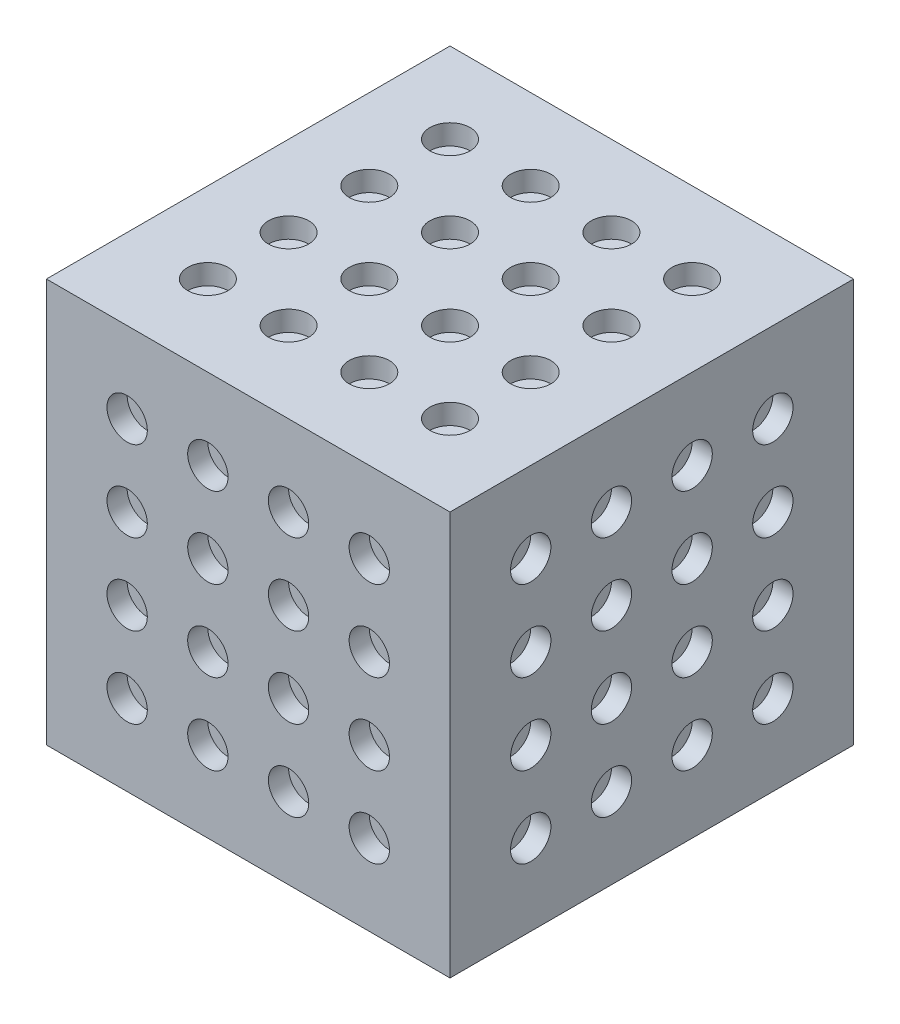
ISO-10303-21;
HEADER;
FILE_DESCRIPTION(('STEP AP214'),'2;1');
FILE_NAME('part.step','',(''),(''),'','','');
FILE_SCHEMA(('AUTOMOTIVE_DESIGN { 1 0 10303 214 1 1 1 1 }'));
ENDSEC;
DATA;
#1=APPLICATION_CONTEXT('core data for automotive mechanical design processes');
#2=APPLICATION_PROTOCOL_DEFINITION('international standard','automotive_design',2000,#1);
#3=PRODUCT_CONTEXT('',#1,'mechanical');
#4=PRODUCT('Part','Part','',(#3));
#5=PRODUCT_RELATED_PRODUCT_CATEGORY('part','',(#4));
#6=PRODUCT_DEFINITION_FORMATION('','',#4);
#7=PRODUCT_DEFINITION_CONTEXT('part definition',#1,'design');
#8=PRODUCT_DEFINITION('design','',#6,#7);
#9=PRODUCT_DEFINITION_SHAPE('','',#8);
#10=(LENGTH_UNIT() NAMED_UNIT(*) SI_UNIT(.MILLI.,.METRE.));
#11=(NAMED_UNIT(*) PLANE_ANGLE_UNIT() SI_UNIT($,.RADIAN.));
#12=(NAMED_UNIT(*) SI_UNIT($,.STERADIAN.) SOLID_ANGLE_UNIT());
#13=UNCERTAINTY_MEASURE_WITH_UNIT(LENGTH_MEASURE(1.E-05),#10,'distance_accuracy_value','');
#14=(GEOMETRIC_REPRESENTATION_CONTEXT(3) GLOBAL_UNCERTAINTY_ASSIGNED_CONTEXT((#13)) GLOBAL_UNIT_ASSIGNED_CONTEXT((#10,
#11,#12)) REPRESENTATION_CONTEXT('',''));
#15=CARTESIAN_POINT('',(0.,0.,0.));
#16=DIRECTION('',(0.,0.,1.));
#17=DIRECTION('',(1.,0.,0.));
#18=AXIS2_PLACEMENT_3D('',#15,#16,#17);
#19=CARTESIAN_POINT('',(0.,0.,100.));
#20=DIRECTION('',(1.,0.,0.));
#21=DIRECTION('',(0.,0.,-1.));
#22=AXIS2_PLACEMENT_3D('',#19,#20,#21);
#23=PLANE('',#22);
#24=DIRECTION('',(0.,-1.,0.));
#25=VECTOR('',#24,1.);
#26=CARTESIAN_POINT('',(0.,0.,0.));
#27=LINE('',#26,#25);
#28=CARTESIAN_POINT('',(0.,100.,0.));
#29=VERTEX_POINT('',#28);
#30=CARTESIAN_POINT('',(0.,0.,0.));
#31=VERTEX_POINT('',#30);
#32=EDGE_CURVE('E101',#29,#31,#27,.T.);
#33=ORIENTED_EDGE('',*,*,#32,.T.);
#34=DIRECTION('',(0.,0.,-1.));
#35=VECTOR('',#34,1.);
#36=CARTESIAN_POINT('',(0.,0.,100.));
#37=LINE('',#36,#35);
#38=CARTESIAN_POINT('',(0.,0.,100.));
#39=VERTEX_POINT('',#38);
#40=EDGE_CURVE('E91',#39,#31,#37,.T.);
#41=ORIENTED_EDGE('',*,*,#40,.F.);
#42=DIRECTION('',(0.,-1.,0.));
#43=VECTOR('',#42,1.);
#44=CARTESIAN_POINT('',(0.,0.,100.));
#45=LINE('',#44,#43);
#46=CARTESIAN_POINT('',(0.,100.,100.));
#47=VERTEX_POINT('',#46);
#48=EDGE_CURVE('E85',#47,#39,#45,.T.);
#49=ORIENTED_EDGE('',*,*,#48,.F.);
#50=DIRECTION('',(0.,0.,-1.));
#51=VECTOR('',#50,1.);
#52=CARTESIAN_POINT('',(0.,100.,100.));
#53=LINE('',#52,#51);
#54=EDGE_CURVE('E97',#47,#29,#53,.T.);
#55=ORIENTED_EDGE('',*,*,#54,.T.);
#56=EDGE_LOOP('',(#33,#41,#49,#55));
#57=FACE_BOUND('',#56,.T.);
#58=ADVANCED_FACE('F31',(#57),#23,.F.);
#59=CARTESIAN_POINT('',(0.,0.,100.));
#60=DIRECTION('',(0.,1.,0.));
#61=DIRECTION('',(0.,0.,1.));
#62=AXIS2_PLACEMENT_3D('',#59,#60,#61);
#63=PLANE('',#62);
#64=DIRECTION('',(1.,0.,0.));
#65=VECTOR('',#64,1.);
#66=CARTESIAN_POINT('',(0.,0.,0.));
#67=LINE('',#66,#65);
#68=CARTESIAN_POINT('',(100.,0.,0.));
#69=VERTEX_POINT('',#68);
#70=EDGE_CURVE('E90',#31,#69,#67,.T.);
#71=ORIENTED_EDGE('',*,*,#70,.T.);
#72=DIRECTION('',(0.,0.,-1.));
#73=VECTOR('',#72,1.);
#74=CARTESIAN_POINT('',(100.,0.,100.));
#75=LINE('',#74,#73);
#76=CARTESIAN_POINT('',(100.,0.,100.));
#77=VERTEX_POINT('',#76);
#78=EDGE_CURVE('E88',#77,#69,#75,.T.);
#79=ORIENTED_EDGE('',*,*,#78,.F.);
#80=DIRECTION('',(1.,0.,0.));
#81=VECTOR('',#80,1.);
#82=CARTESIAN_POINT('',(0.,0.,100.));
#83=LINE('',#82,#81);
#84=EDGE_CURVE('E79',#39,#77,#83,.T.);
#85=ORIENTED_EDGE('',*,*,#84,.F.);
#86=ORIENTED_EDGE('',*,*,#40,.T.);
#87=EDGE_LOOP('',(#71,#79,#85,#86));
#88=FACE_BOUND('',#87,.T.);
#89=ADVANCED_FACE('F89',(#88),#63,.F.);
#90=CARTESIAN_POINT('',(100.,0.,100.));
#91=DIRECTION('',(-1.,0.,0.));
#92=DIRECTION('',(0.,0.,1.));
#93=AXIS2_PLACEMENT_3D('',#90,#91,#92);
#94=PLANE('',#93);
#95=CARTESIAN_POINT('',(100.,80.,60.));
#96=DIRECTION('',(1.,0.,0.));
#97=DIRECTION('',(0.,0.,-1.));
#98=AXIS2_PLACEMENT_3D('',#95,#96,#97);
#99=CIRCLE('',#98,5.00000000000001);
#100=CARTESIAN_POINT('',(100.,80.,55.));
#101=VERTEX_POINT('',#100);
#102=EDGE_CURVE('E1436',#101,#101,#99,.T.);
#103=ORIENTED_EDGE('',*,*,#102,.F.);
#104=EDGE_LOOP('',(#103));
#105=FACE_BOUND('',#104,.T.);
#106=CARTESIAN_POINT('',(100.,80.,80.));
#107=DIRECTION('',(1.,0.,0.));
#108=DIRECTION('',(0.,0.,-1.));
#109=AXIS2_PLACEMENT_3D('',#106,#107,#108);
#110=CIRCLE('',#109,5.00000000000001);
#111=CARTESIAN_POINT('',(100.,80.,75.));
#112=VERTEX_POINT('',#111);
#113=EDGE_CURVE('E1428',#112,#112,#110,.T.);
#114=ORIENTED_EDGE('',*,*,#113,.F.);
#115=EDGE_LOOP('',(#114));
#116=FACE_BOUND('',#115,.T.);
#117=DIRECTION('',(0.,1.,0.));
#118=VECTOR('',#117,1.);
#119=CARTESIAN_POINT('',(100.,0.,0.));
#120=LINE('',#119,#118);
#121=CARTESIAN_POINT('',(100.,100.,0.));
#122=VERTEX_POINT('',#121);
#123=EDGE_CURVE('E65',#69,#122,#120,.T.);
#124=ORIENTED_EDGE('',*,*,#123,.T.);
#125=DIRECTION('',(0.,0.,-1.));
#126=VECTOR('',#125,1.);
#127=CARTESIAN_POINT('',(100.,100.,100.));
#128=LINE('',#127,#126);
#129=CARTESIAN_POINT('',(100.,100.,100.));
#130=VERTEX_POINT('',#129);
#131=EDGE_CURVE('E92',#130,#122,#128,.T.);
#132=ORIENTED_EDGE('',*,*,#131,.F.);
#133=DIRECTION('',(0.,1.,0.));
#134=VECTOR('',#133,1.);
#135=CARTESIAN_POINT('',(100.,0.,100.));
#136=LINE('',#135,#134);
#137=EDGE_CURVE('E83',#77,#130,#136,.T.);
#138=ORIENTED_EDGE('',*,*,#137,.F.);
#139=ORIENTED_EDGE('',*,*,#78,.T.);
#140=EDGE_LOOP('',(#124,#132,#138,#139));
#141=FACE_BOUND('',#140,.T.);
#142=CARTESIAN_POINT('',(100.,80.,40.));
#143=DIRECTION('',(1.,0.,0.));
#144=DIRECTION('',(0.,0.,-1.));
#145=AXIS2_PLACEMENT_3D('',#142,#143,#144);
#146=CIRCLE('',#145,5.00000000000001);
#147=CARTESIAN_POINT('',(100.,80.,35.));
#148=VERTEX_POINT('',#147);
#149=EDGE_CURVE('E195',#148,#148,#146,.T.);
#150=ORIENTED_EDGE('',*,*,#149,.F.);
#151=EDGE_LOOP('',(#150));
#152=FACE_BOUND('',#151,.T.);
#153=CARTESIAN_POINT('',(100.,80.,20.));
#154=DIRECTION('',(1.,0.,0.));
#155=DIRECTION('',(0.,0.,-1.));
#156=AXIS2_PLACEMENT_3D('',#153,#154,#155);
#157=CIRCLE('',#156,5.00000000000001);
#158=CARTESIAN_POINT('',(100.,80.,15.));
#159=VERTEX_POINT('',#158);
#160=EDGE_CURVE('E201',#159,#159,#157,.T.);
#161=ORIENTED_EDGE('',*,*,#160,.F.);
#162=EDGE_LOOP('',(#161));
#163=FACE_BOUND('',#162,.T.);
#164=CARTESIAN_POINT('',(100.,60.,80.));
#165=DIRECTION('',(1.,0.,0.));
#166=DIRECTION('',(0.,0.,-1.));
#167=AXIS2_PLACEMENT_3D('',#164,#165,#166);
#168=CIRCLE('',#167,5.00000000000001);
#169=CARTESIAN_POINT('',(100.,60.,75.));
#170=VERTEX_POINT('',#169);
#171=EDGE_CURVE('E207',#170,#170,#168,.T.);
#172=ORIENTED_EDGE('',*,*,#171,.F.);
#173=EDGE_LOOP('',(#172));
#174=FACE_BOUND('',#173,.T.);
#175=CARTESIAN_POINT('',(100.,60.,60.));
#176=DIRECTION('',(1.,0.,0.));
#177=DIRECTION('',(0.,0.,-1.));
#178=AXIS2_PLACEMENT_3D('',#175,#176,#177);
#179=CIRCLE('',#178,5.00000000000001);
#180=CARTESIAN_POINT('',(100.,60.,55.));
#181=VERTEX_POINT('',#180);
#182=EDGE_CURVE('E213',#181,#181,#179,.T.);
#183=ORIENTED_EDGE('',*,*,#182,.F.);
#184=EDGE_LOOP('',(#183));
#185=FACE_BOUND('',#184,.T.);
#186=CARTESIAN_POINT('',(100.,60.,40.));
#187=DIRECTION('',(1.,0.,0.));
#188=DIRECTION('',(0.,0.,-1.));
#189=AXIS2_PLACEMENT_3D('',#186,#187,#188);
#190=CIRCLE('',#189,5.00000000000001);
#191=CARTESIAN_POINT('',(100.,60.,35.));
#192=VERTEX_POINT('',#191);
#193=EDGE_CURVE('E219',#192,#192,#190,.T.);
#194=ORIENTED_EDGE('',*,*,#193,.F.);
#195=EDGE_LOOP('',(#194));
#196=FACE_BOUND('',#195,.T.);
#197=CARTESIAN_POINT('',(100.,60.,20.));
#198=DIRECTION('',(1.,0.,0.));
#199=DIRECTION('',(0.,0.,-1.));
#200=AXIS2_PLACEMENT_3D('',#197,#198,#199);
#201=CIRCLE('',#200,5.00000000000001);
#202=CARTESIAN_POINT('',(100.,60.,15.));
#203=VERTEX_POINT('',#202);
#204=EDGE_CURVE('E225',#203,#203,#201,.T.);
#205=ORIENTED_EDGE('',*,*,#204,.F.);
#206=EDGE_LOOP('',(#205));
#207=FACE_BOUND('',#206,.T.);
#208=CARTESIAN_POINT('',(100.,40.,80.));
#209=DIRECTION('',(1.,0.,0.));
#210=DIRECTION('',(0.,0.,-1.));
#211=AXIS2_PLACEMENT_3D('',#208,#209,#210);
#212=CIRCLE('',#211,5.00000000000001);
#213=CARTESIAN_POINT('',(100.,40.,75.));
#214=VERTEX_POINT('',#213);
#215=EDGE_CURVE('E231',#214,#214,#212,.T.);
#216=ORIENTED_EDGE('',*,*,#215,.F.);
#217=EDGE_LOOP('',(#216));
#218=FACE_BOUND('',#217,.T.);
#219=CARTESIAN_POINT('',(100.,40.,60.));
#220=DIRECTION('',(1.,0.,0.));
#221=DIRECTION('',(0.,0.,-1.));
#222=AXIS2_PLACEMENT_3D('',#219,#220,#221);
#223=CIRCLE('',#222,5.00000000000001);
#224=CARTESIAN_POINT('',(100.,40.,55.));
#225=VERTEX_POINT('',#224);
#226=EDGE_CURVE('E237',#225,#225,#223,.T.);
#227=ORIENTED_EDGE('',*,*,#226,.F.);
#228=EDGE_LOOP('',(#227));
#229=FACE_BOUND('',#228,.T.);
#230=CARTESIAN_POINT('',(100.,40.,40.));
#231=DIRECTION('',(1.,0.,0.));
#232=DIRECTION('',(0.,0.,-1.));
#233=AXIS2_PLACEMENT_3D('',#230,#231,#232);
#234=CIRCLE('',#233,5.00000000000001);
#235=CARTESIAN_POINT('',(100.,40.,35.));
#236=VERTEX_POINT('',#235);
#237=EDGE_CURVE('E243',#236,#236,#234,.T.);
#238=ORIENTED_EDGE('',*,*,#237,.F.);
#239=EDGE_LOOP('',(#238));
#240=FACE_BOUND('',#239,.T.);
#241=CARTESIAN_POINT('',(100.,40.,20.));
#242=DIRECTION('',(1.,0.,0.));
#243=DIRECTION('',(0.,0.,-1.));
#244=AXIS2_PLACEMENT_3D('',#241,#242,#243);
#245=CIRCLE('',#244,5.00000000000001);
#246=CARTESIAN_POINT('',(100.,40.,15.));
#247=VERTEX_POINT('',#246);
#248=EDGE_CURVE('E249',#247,#247,#245,.T.);
#249=ORIENTED_EDGE('',*,*,#248,.F.);
#250=EDGE_LOOP('',(#249));
#251=FACE_BOUND('',#250,.T.);
#252=CARTESIAN_POINT('',(100.,20.,80.));
#253=DIRECTION('',(1.,0.,0.));
#254=DIRECTION('',(0.,0.,-1.));
#255=AXIS2_PLACEMENT_3D('',#252,#253,#254);
#256=CIRCLE('',#255,5.00000000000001);
#257=CARTESIAN_POINT('',(100.,20.,75.));
#258=VERTEX_POINT('',#257);
#259=EDGE_CURVE('E255',#258,#258,#256,.T.);
#260=ORIENTED_EDGE('',*,*,#259,.F.);
#261=EDGE_LOOP('',(#260));
#262=FACE_BOUND('',#261,.T.);
#263=CARTESIAN_POINT('',(100.,20.,60.));
#264=DIRECTION('',(1.,0.,0.));
#265=DIRECTION('',(0.,0.,-1.));
#266=AXIS2_PLACEMENT_3D('',#263,#264,#265);
#267=CIRCLE('',#266,5.00000000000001);
#268=CARTESIAN_POINT('',(100.,20.,55.));
#269=VERTEX_POINT('',#268);
#270=EDGE_CURVE('E261',#269,#269,#267,.T.);
#271=ORIENTED_EDGE('',*,*,#270,.F.);
#272=EDGE_LOOP('',(#271));
#273=FACE_BOUND('',#272,.T.);
#274=CARTESIAN_POINT('',(100.,20.,40.));
#275=DIRECTION('',(1.,0.,0.));
#276=DIRECTION('',(0.,0.,-1.));
#277=AXIS2_PLACEMENT_3D('',#274,#275,#276);
#278=CIRCLE('',#277,5.00000000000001);
#279=CARTESIAN_POINT('',(100.,20.,35.));
#280=VERTEX_POINT('',#279);
#281=EDGE_CURVE('E267',#280,#280,#278,.T.);
#282=ORIENTED_EDGE('',*,*,#281,.F.);
#283=EDGE_LOOP('',(#282));
#284=FACE_BOUND('',#283,.T.);
#285=CARTESIAN_POINT('',(100.,20.,20.));
#286=DIRECTION('',(1.,0.,0.));
#287=DIRECTION('',(0.,0.,-1.));
#288=AXIS2_PLACEMENT_3D('',#285,#286,#287);
#289=CIRCLE('',#288,5.00000000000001);
#290=CARTESIAN_POINT('',(100.,20.,15.));
#291=VERTEX_POINT('',#290);
#292=EDGE_CURVE('E273',#291,#291,#289,.T.);
#293=ORIENTED_EDGE('',*,*,#292,.F.);
#294=EDGE_LOOP('',(#293));
#295=FACE_BOUND('',#294,.T.);
#296=ADVANCED_FACE('F94',(#105,#116,#141,#152,#163,#174,#185,#196,#207,#218,#229,#240,#251,#262,
#273,#284,#295),#94,.F.);
#297=CARTESIAN_POINT('',(0.,100.,100.));
#298=DIRECTION('',(0.,-1.,0.));
#299=DIRECTION('',(0.,0.,-1.));
#300=AXIS2_PLACEMENT_3D('',#297,#298,#299);
#301=PLANE('',#300);
#302=CARTESIAN_POINT('',(20.,100.,60.));
#303=DIRECTION('',(0.,1.,0.));
#304=DIRECTION('',(0.,0.,1.));
#305=AXIS2_PLACEMENT_3D('',#302,#303,#304);
#306=CIRCLE('',#305,5.00000000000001);
#307=CARTESIAN_POINT('',(20.,100.,65.));
#308=VERTEX_POINT('',#307);
#309=EDGE_CURVE('E1448',#308,#308,#306,.T.);
#310=ORIENTED_EDGE('',*,*,#309,.F.);
#311=EDGE_LOOP('',(#310));
#312=FACE_BOUND('',#311,.T.);
#313=CARTESIAN_POINT('',(20.,100.,80.));
#314=DIRECTION('',(0.,1.,0.));
#315=DIRECTION('',(0.,0.,1.));
#316=AXIS2_PLACEMENT_3D('',#313,#314,#315);
#317=CIRCLE('',#316,5.00000000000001);
#318=CARTESIAN_POINT('',(20.,100.,85.));
#319=VERTEX_POINT('',#318);
#320=EDGE_CURVE('E1440',#319,#319,#317,.T.);
#321=ORIENTED_EDGE('',*,*,#320,.F.);
#322=EDGE_LOOP('',(#321));
#323=FACE_BOUND('',#322,.T.);
#324=DIRECTION('',(-1.,0.,0.));
#325=VECTOR('',#324,1.);
#326=CARTESIAN_POINT('',(0.,100.,0.));
#327=LINE('',#326,#325);
#328=EDGE_CURVE('E71',#122,#29,#327,.T.);
#329=ORIENTED_EDGE('',*,*,#328,.T.);
#330=ORIENTED_EDGE('',*,*,#54,.F.);
#331=DIRECTION('',(-1.,0.,0.));
#332=VECTOR('',#331,1.);
#333=CARTESIAN_POINT('',(0.,100.,100.));
#334=LINE('',#333,#332);
#335=EDGE_CURVE('E48',#130,#47,#334,.T.);
#336=ORIENTED_EDGE('',*,*,#335,.F.);
#337=ORIENTED_EDGE('',*,*,#131,.T.);
#338=EDGE_LOOP('',(#329,#330,#336,#337));
#339=FACE_BOUND('',#338,.T.);
#340=CARTESIAN_POINT('',(20.,100.,40.));
#341=DIRECTION('',(0.,1.,0.));
#342=DIRECTION('',(0.,0.,1.));
#343=AXIS2_PLACEMENT_3D('',#340,#341,#342);
#344=CIRCLE('',#343,5.00000000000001);
#345=CARTESIAN_POINT('',(20.,100.,45.));
#346=VERTEX_POINT('',#345);
#347=EDGE_CURVE('E279',#346,#346,#344,.T.);
#348=ORIENTED_EDGE('',*,*,#347,.F.);
#349=EDGE_LOOP('',(#348));
#350=FACE_BOUND('',#349,.T.);
#351=CARTESIAN_POINT('',(20.,100.,20.));
#352=DIRECTION('',(0.,1.,0.));
#353=DIRECTION('',(0.,0.,1.));
#354=AXIS2_PLACEMENT_3D('',#351,#352,#353);
#355=CIRCLE('',#354,5.00000000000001);
#356=CARTESIAN_POINT('',(20.,100.,25.));
#357=VERTEX_POINT('',#356);
#358=EDGE_CURVE('E285',#357,#357,#355,.T.);
#359=ORIENTED_EDGE('',*,*,#358,.F.);
#360=EDGE_LOOP('',(#359));
#361=FACE_BOUND('',#360,.T.);
#362=CARTESIAN_POINT('',(40.,100.,80.));
#363=DIRECTION('',(0.,1.,0.));
#364=DIRECTION('',(0.,0.,1.));
#365=AXIS2_PLACEMENT_3D('',#362,#363,#364);
#366=CIRCLE('',#365,5.00000000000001);
#367=CARTESIAN_POINT('',(40.,100.,85.));
#368=VERTEX_POINT('',#367);
#369=EDGE_CURVE('E291',#368,#368,#366,.T.);
#370=ORIENTED_EDGE('',*,*,#369,.F.);
#371=EDGE_LOOP('',(#370));
#372=FACE_BOUND('',#371,.T.);
#373=CARTESIAN_POINT('',(40.,100.,60.));
#374=DIRECTION('',(0.,1.,0.));
#375=DIRECTION('',(0.,0.,1.));
#376=AXIS2_PLACEMENT_3D('',#373,#374,#375);
#377=CIRCLE('',#376,5.00000000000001);
#378=CARTESIAN_POINT('',(40.,100.,65.));
#379=VERTEX_POINT('',#378);
#380=EDGE_CURVE('E297',#379,#379,#377,.T.);
#381=ORIENTED_EDGE('',*,*,#380,.F.);
#382=EDGE_LOOP('',(#381));
#383=FACE_BOUND('',#382,.T.);
#384=CARTESIAN_POINT('',(40.,100.,40.));
#385=DIRECTION('',(0.,1.,0.));
#386=DIRECTION('',(0.,0.,1.));
#387=AXIS2_PLACEMENT_3D('',#384,#385,#386);
#388=CIRCLE('',#387,5.00000000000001);
#389=CARTESIAN_POINT('',(40.,100.,45.));
#390=VERTEX_POINT('',#389);
#391=EDGE_CURVE('E303',#390,#390,#388,.T.);
#392=ORIENTED_EDGE('',*,*,#391,.F.);
#393=EDGE_LOOP('',(#392));
#394=FACE_BOUND('',#393,.T.);
#395=CARTESIAN_POINT('',(40.,100.,20.));
#396=DIRECTION('',(0.,1.,0.));
#397=DIRECTION('',(0.,0.,1.));
#398=AXIS2_PLACEMENT_3D('',#395,#396,#397);
#399=CIRCLE('',#398,5.00000000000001);
#400=CARTESIAN_POINT('',(40.,100.,25.));
#401=VERTEX_POINT('',#400);
#402=EDGE_CURVE('E309',#401,#401,#399,.T.);
#403=ORIENTED_EDGE('',*,*,#402,.F.);
#404=EDGE_LOOP('',(#403));
#405=FACE_BOUND('',#404,.T.);
#406=CARTESIAN_POINT('',(60.,100.,80.));
#407=DIRECTION('',(0.,1.,0.));
#408=DIRECTION('',(0.,0.,1.));
#409=AXIS2_PLACEMENT_3D('',#406,#407,#408);
#410=CIRCLE('',#409,5.00000000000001);
#411=CARTESIAN_POINT('',(60.,100.,85.));
#412=VERTEX_POINT('',#411);
#413=EDGE_CURVE('E315',#412,#412,#410,.T.);
#414=ORIENTED_EDGE('',*,*,#413,.F.);
#415=EDGE_LOOP('',(#414));
#416=FACE_BOUND('',#415,.T.);
#417=CARTESIAN_POINT('',(60.,100.,60.));
#418=DIRECTION('',(0.,1.,0.));
#419=DIRECTION('',(0.,0.,1.));
#420=AXIS2_PLACEMENT_3D('',#417,#418,#419);
#421=CIRCLE('',#420,5.00000000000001);
#422=CARTESIAN_POINT('',(60.,100.,65.));
#423=VERTEX_POINT('',#422);
#424=EDGE_CURVE('E321',#423,#423,#421,.T.);
#425=ORIENTED_EDGE('',*,*,#424,.F.);
#426=EDGE_LOOP('',(#425));
#427=FACE_BOUND('',#426,.T.);
#428=CARTESIAN_POINT('',(60.,100.,40.));
#429=DIRECTION('',(0.,1.,0.));
#430=DIRECTION('',(0.,0.,1.));
#431=AXIS2_PLACEMENT_3D('',#428,#429,#430);
#432=CIRCLE('',#431,5.00000000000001);
#433=CARTESIAN_POINT('',(60.,100.,45.));
#434=VERTEX_POINT('',#433);
#435=EDGE_CURVE('E327',#434,#434,#432,.T.);
#436=ORIENTED_EDGE('',*,*,#435,.F.);
#437=EDGE_LOOP('',(#436));
#438=FACE_BOUND('',#437,.T.);
#439=CARTESIAN_POINT('',(60.,100.,20.));
#440=DIRECTION('',(0.,1.,0.));
#441=DIRECTION('',(0.,0.,1.));
#442=AXIS2_PLACEMENT_3D('',#439,#440,#441);
#443=CIRCLE('',#442,5.00000000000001);
#444=CARTESIAN_POINT('',(60.,100.,25.));
#445=VERTEX_POINT('',#444);
#446=EDGE_CURVE('E333',#445,#445,#443,.T.);
#447=ORIENTED_EDGE('',*,*,#446,.F.);
#448=EDGE_LOOP('',(#447));
#449=FACE_BOUND('',#448,.T.);
#450=CARTESIAN_POINT('',(80.,100.,80.));
#451=DIRECTION('',(0.,1.,0.));
#452=DIRECTION('',(0.,0.,1.));
#453=AXIS2_PLACEMENT_3D('',#450,#451,#452);
#454=CIRCLE('',#453,5.00000000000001);
#455=CARTESIAN_POINT('',(80.,100.,85.));
#456=VERTEX_POINT('',#455);
#457=EDGE_CURVE('E339',#456,#456,#454,.T.);
#458=ORIENTED_EDGE('',*,*,#457,.F.);
#459=EDGE_LOOP('',(#458));
#460=FACE_BOUND('',#459,.T.);
#461=CARTESIAN_POINT('',(80.,100.,60.));
#462=DIRECTION('',(0.,1.,0.));
#463=DIRECTION('',(0.,0.,1.));
#464=AXIS2_PLACEMENT_3D('',#461,#462,#463);
#465=CIRCLE('',#464,5.00000000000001);
#466=CARTESIAN_POINT('',(80.,100.,65.));
#467=VERTEX_POINT('',#466);
#468=EDGE_CURVE('E345',#467,#467,#465,.T.);
#469=ORIENTED_EDGE('',*,*,#468,.F.);
#470=EDGE_LOOP('',(#469));
#471=FACE_BOUND('',#470,.T.);
#472=CARTESIAN_POINT('',(80.,100.,40.));
#473=DIRECTION('',(0.,1.,0.));
#474=DIRECTION('',(0.,0.,1.));
#475=AXIS2_PLACEMENT_3D('',#472,#473,#474);
#476=CIRCLE('',#475,5.00000000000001);
#477=CARTESIAN_POINT('',(80.,100.,45.));
#478=VERTEX_POINT('',#477);
#479=EDGE_CURVE('E351',#478,#478,#476,.T.);
#480=ORIENTED_EDGE('',*,*,#479,.F.);
#481=EDGE_LOOP('',(#480));
#482=FACE_BOUND('',#481,.T.);
#483=CARTESIAN_POINT('',(80.,100.,20.));
#484=DIRECTION('',(0.,1.,0.));
#485=DIRECTION('',(0.,0.,1.));
#486=AXIS2_PLACEMENT_3D('',#483,#484,#485);
#487=CIRCLE('',#486,5.00000000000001);
#488=CARTESIAN_POINT('',(80.,100.,25.));
#489=VERTEX_POINT('',#488);
#490=EDGE_CURVE('E40',#489,#489,#487,.T.);
#491=ORIENTED_EDGE('',*,*,#490,.F.);
#492=EDGE_LOOP('',(#491));
#493=FACE_BOUND('',#492,.T.);
#494=ADVANCED_FACE('F361',(#312,#323,#339,#350,#361,#372,#383,#394,#405,#416,#427,#438,#449,
#460,#471,#482,#493),#301,.F.);
#495=CARTESIAN_POINT('',(0.,100.,100.));
#496=DIRECTION('',(0.,0.,-1.));
#497=DIRECTION('',(-1.,0.,0.));
#498=AXIS2_PLACEMENT_3D('',#495,#496,#497);
#499=PLANE('',#498);
#500=CARTESIAN_POINT('',(40.,80.,100.));
#501=DIRECTION('',(0.,0.,1.));
#502=DIRECTION('',(1.,0.,0.));
#503=AXIS2_PLACEMENT_3D('',#500,#501,#502);
#504=CIRCLE('',#503,5.);
#505=CARTESIAN_POINT('',(45.,80.,100.));
#506=VERTEX_POINT('',#505);
#507=EDGE_CURVE('E1424',#506,#506,#504,.T.);
#508=ORIENTED_EDGE('',*,*,#507,.F.);
#509=EDGE_LOOP('',(#508));
#510=FACE_BOUND('',#509,.T.);
#511=CARTESIAN_POINT('',(20.,80.,100.));
#512=DIRECTION('',(0.,0.,1.));
#513=DIRECTION('',(1.,0.,0.));
#514=AXIS2_PLACEMENT_3D('',#511,#512,#513);
#515=CIRCLE('',#514,5.);
#516=CARTESIAN_POINT('',(25.,80.,100.));
#517=VERTEX_POINT('',#516);
#518=EDGE_CURVE('E1416',#517,#517,#515,.T.);
#519=ORIENTED_EDGE('',*,*,#518,.F.);
#520=EDGE_LOOP('',(#519));
#521=FACE_BOUND('',#520,.T.);
#522=ORIENTED_EDGE('',*,*,#48,.T.);
#523=ORIENTED_EDGE('',*,*,#84,.T.);
#524=ORIENTED_EDGE('',*,*,#137,.T.);
#525=ORIENTED_EDGE('',*,*,#335,.T.);
#526=EDGE_LOOP('',(#522,#523,#524,#525));
#527=FACE_BOUND('',#526,.T.);
#528=CARTESIAN_POINT('',(60.,80.,100.));
#529=DIRECTION('',(0.,0.,1.));
#530=DIRECTION('',(1.,0.,0.));
#531=AXIS2_PLACEMENT_3D('',#528,#529,#530);
#532=CIRCLE('',#531,5.);
#533=CARTESIAN_POINT('',(65.,80.,100.));
#534=VERTEX_POINT('',#533);
#535=EDGE_CURVE('E111',#534,#534,#532,.T.);
#536=ORIENTED_EDGE('',*,*,#535,.F.);
#537=EDGE_LOOP('',(#536));
#538=FACE_BOUND('',#537,.T.);
#539=CARTESIAN_POINT('',(80.,80.,100.));
#540=DIRECTION('',(0.,0.,1.));
#541=DIRECTION('',(1.,0.,0.));
#542=AXIS2_PLACEMENT_3D('',#539,#540,#541);
#543=CIRCLE('',#542,5.);
#544=CARTESIAN_POINT('',(85.,80.,100.));
#545=VERTEX_POINT('',#544);
#546=EDGE_CURVE('E117',#545,#545,#543,.T.);
#547=ORIENTED_EDGE('',*,*,#546,.F.);
#548=EDGE_LOOP('',(#547));
#549=FACE_BOUND('',#548,.T.);
#550=CARTESIAN_POINT('',(20.,60.,100.));
#551=DIRECTION('',(0.,0.,1.));
#552=DIRECTION('',(1.,0.,0.));
#553=AXIS2_PLACEMENT_3D('',#550,#551,#552);
#554=CIRCLE('',#553,5.);
#555=CARTESIAN_POINT('',(25.,60.,100.));
#556=VERTEX_POINT('',#555);
#557=EDGE_CURVE('E123',#556,#556,#554,.T.);
#558=ORIENTED_EDGE('',*,*,#557,.F.);
#559=EDGE_LOOP('',(#558));
#560=FACE_BOUND('',#559,.T.);
#561=CARTESIAN_POINT('',(40.,60.,100.));
#562=DIRECTION('',(0.,0.,1.));
#563=DIRECTION('',(1.,0.,0.));
#564=AXIS2_PLACEMENT_3D('',#561,#562,#563);
#565=CIRCLE('',#564,5.);
#566=CARTESIAN_POINT('',(45.,60.,100.));
#567=VERTEX_POINT('',#566);
#568=EDGE_CURVE('E129',#567,#567,#565,.T.);
#569=ORIENTED_EDGE('',*,*,#568,.F.);
#570=EDGE_LOOP('',(#569));
#571=FACE_BOUND('',#570,.T.);
#572=CARTESIAN_POINT('',(60.,60.,100.));
#573=DIRECTION('',(0.,0.,1.));
#574=DIRECTION('',(1.,0.,0.));
#575=AXIS2_PLACEMENT_3D('',#572,#573,#574);
#576=CIRCLE('',#575,5.);
#577=CARTESIAN_POINT('',(65.,60.,100.));
#578=VERTEX_POINT('',#577);
#579=EDGE_CURVE('E135',#578,#578,#576,.T.);
#580=ORIENTED_EDGE('',*,*,#579,.F.);
#581=EDGE_LOOP('',(#580));
#582=FACE_BOUND('',#581,.T.);
#583=CARTESIAN_POINT('',(80.,60.,100.));
#584=DIRECTION('',(0.,0.,1.));
#585=DIRECTION('',(1.,0.,0.));
#586=AXIS2_PLACEMENT_3D('',#583,#584,#585);
#587=CIRCLE('',#586,5.);
#588=CARTESIAN_POINT('',(85.,60.,100.));
#589=VERTEX_POINT('',#588);
#590=EDGE_CURVE('E141',#589,#589,#587,.T.);
#591=ORIENTED_EDGE('',*,*,#590,.F.);
#592=EDGE_LOOP('',(#591));
#593=FACE_BOUND('',#592,.T.);
#594=CARTESIAN_POINT('',(20.,40.,100.));
#595=DIRECTION('',(0.,0.,1.));
#596=DIRECTION('',(1.,0.,0.));
#597=AXIS2_PLACEMENT_3D('',#594,#595,#596);
#598=CIRCLE('',#597,5.);
#599=CARTESIAN_POINT('',(25.,40.,100.));
#600=VERTEX_POINT('',#599);
#601=EDGE_CURVE('E147',#600,#600,#598,.T.);
#602=ORIENTED_EDGE('',*,*,#601,.F.);
#603=EDGE_LOOP('',(#602));
#604=FACE_BOUND('',#603,.T.);
#605=CARTESIAN_POINT('',(40.,40.,100.));
#606=DIRECTION('',(0.,0.,1.));
#607=DIRECTION('',(1.,0.,0.));
#608=AXIS2_PLACEMENT_3D('',#605,#606,#607);
#609=CIRCLE('',#608,5.);
#610=CARTESIAN_POINT('',(45.,40.,100.));
#611=VERTEX_POINT('',#610);
#612=EDGE_CURVE('E153',#611,#611,#609,.T.);
#613=ORIENTED_EDGE('',*,*,#612,.F.);
#614=EDGE_LOOP('',(#613));
#615=FACE_BOUND('',#614,.T.);
#616=CARTESIAN_POINT('',(60.,40.,100.));
#617=DIRECTION('',(0.,0.,1.));
#618=DIRECTION('',(1.,0.,0.));
#619=AXIS2_PLACEMENT_3D('',#616,#617,#618);
#620=CIRCLE('',#619,5.);
#621=CARTESIAN_POINT('',(65.,40.,100.));
#622=VERTEX_POINT('',#621);
#623=EDGE_CURVE('E159',#622,#622,#620,.T.);
#624=ORIENTED_EDGE('',*,*,#623,.F.);
#625=EDGE_LOOP('',(#624));
#626=FACE_BOUND('',#625,.T.);
#627=CARTESIAN_POINT('',(80.,40.,100.));
#628=DIRECTION('',(0.,0.,1.));
#629=DIRECTION('',(1.,0.,0.));
#630=AXIS2_PLACEMENT_3D('',#627,#628,#629);
#631=CIRCLE('',#630,5.);
#632=CARTESIAN_POINT('',(85.,40.,100.));
#633=VERTEX_POINT('',#632);
#634=EDGE_CURVE('E165',#633,#633,#631,.T.);
#635=ORIENTED_EDGE('',*,*,#634,.F.);
#636=EDGE_LOOP('',(#635));
#637=FACE_BOUND('',#636,.T.);
#638=CARTESIAN_POINT('',(20.,20.,100.));
#639=DIRECTION('',(0.,0.,1.));
#640=DIRECTION('',(1.,0.,0.));
#641=AXIS2_PLACEMENT_3D('',#638,#639,#640);
#642=CIRCLE('',#641,5.);
#643=CARTESIAN_POINT('',(25.,20.,100.));
#644=VERTEX_POINT('',#643);
#645=EDGE_CURVE('E171',#644,#644,#642,.T.);
#646=ORIENTED_EDGE('',*,*,#645,.F.);
#647=EDGE_LOOP('',(#646));
#648=FACE_BOUND('',#647,.T.);
#649=CARTESIAN_POINT('',(40.,20.,100.));
#650=DIRECTION('',(0.,0.,1.));
#651=DIRECTION('',(1.,0.,0.));
#652=AXIS2_PLACEMENT_3D('',#649,#650,#651);
#653=CIRCLE('',#652,5.);
#654=CARTESIAN_POINT('',(45.,20.,100.));
#655=VERTEX_POINT('',#654);
#656=EDGE_CURVE('E177',#655,#655,#653,.T.);
#657=ORIENTED_EDGE('',*,*,#656,.F.);
#658=EDGE_LOOP('',(#657));
#659=FACE_BOUND('',#658,.T.);
#660=CARTESIAN_POINT('',(60.,20.,100.));
#661=DIRECTION('',(0.,0.,1.));
#662=DIRECTION('',(1.,0.,0.));
#663=AXIS2_PLACEMENT_3D('',#660,#661,#662);
#664=CIRCLE('',#663,5.);
#665=CARTESIAN_POINT('',(65.,20.,100.));
#666=VERTEX_POINT('',#665);
#667=EDGE_CURVE('E183',#666,#666,#664,.T.);
#668=ORIENTED_EDGE('',*,*,#667,.F.);
#669=EDGE_LOOP('',(#668));
#670=FACE_BOUND('',#669,.T.);
#671=CARTESIAN_POINT('',(80.,20.,100.));
#672=DIRECTION('',(0.,0.,1.));
#673=DIRECTION('',(1.,0.,0.));
#674=AXIS2_PLACEMENT_3D('',#671,#672,#673);
#675=CIRCLE('',#674,5.);
#676=CARTESIAN_POINT('',(85.,20.,100.));
#677=VERTEX_POINT('',#676);
#678=EDGE_CURVE('E189',#677,#677,#675,.T.);
#679=ORIENTED_EDGE('',*,*,#678,.F.);
#680=EDGE_LOOP('',(#679));
#681=FACE_BOUND('',#680,.T.);
#682=ADVANCED_FACE('F80',(#510,#521,#527,#538,#549,#560,#571,#582,#593,#604,#615,#626,#637,#648,
#659,#670,#681),#499,.F.);
#683=CARTESIAN_POINT('',(0.,100.,0.));
#684=DIRECTION('',(0.,0.,-1.));
#685=DIRECTION('',(-1.,0.,0.));
#686=AXIS2_PLACEMENT_3D('',#683,#684,#685);
#687=PLANE('',#686);
#688=ORIENTED_EDGE('',*,*,#32,.F.);
#689=ORIENTED_EDGE('',*,*,#328,.F.);
#690=ORIENTED_EDGE('',*,*,#123,.F.);
#691=ORIENTED_EDGE('',*,*,#70,.F.);
#692=EDGE_LOOP('',(#688,#689,#690,#691));
#693=FACE_BOUND('',#692,.T.);
#694=ADVANCED_FACE('F369',(#693),#687,.T.);
#695=CARTESIAN_POINT('',(20.,80.,95.));
#696=DIRECTION('',(0.,0.,1.));
#697=DIRECTION('',(1.,0.,0.));
#698=AXIS2_PLACEMENT_3D('',#695,#696,#697);
#699=CYLINDRICAL_SURFACE('',#698,5.);
#700=CARTESIAN_POINT('',(20.,80.,95.));
#701=DIRECTION('',(0.,0.,1.));
#702=DIRECTION('',(1.,0.,0.));
#703=AXIS2_PLACEMENT_3D('',#700,#701,#702);
#704=CIRCLE('',#703,5.);
#705=CARTESIAN_POINT('',(25.,80.,95.));
#706=VERTEX_POINT('',#705);
#707=EDGE_CURVE('E104',#706,#706,#704,.T.);
#708=ORIENTED_EDGE('',*,*,#707,.F.);
#709=EDGE_LOOP('',(#708));
#710=FACE_BOUND('',#709,.T.);
#711=ORIENTED_EDGE('',*,*,#518,.T.);
#712=EDGE_LOOP('',(#711));
#713=FACE_BOUND('',#712,.T.);
#714=ADVANCED_FACE('F1138',(#710,#713),#699,.F.);
#715=CARTESIAN_POINT('',(20.,80.,95.));
#716=DIRECTION('',(0.,0.,1.));
#717=DIRECTION('',(1.,0.,0.));
#718=AXIS2_PLACEMENT_3D('',#715,#716,#717);
#719=PLANE('',#718);
#720=ORIENTED_EDGE('',*,*,#707,.T.);
#721=EDGE_LOOP('',(#720));
#722=FACE_BOUND('',#721,.T.);
#723=ADVANCED_FACE('F1124',(#722),#719,.T.);
#724=CARTESIAN_POINT('',(40.,80.,95.));
#725=DIRECTION('',(0.,0.,1.));
#726=DIRECTION('',(1.,0.,0.));
#727=AXIS2_PLACEMENT_3D('',#724,#725,#726);
#728=CYLINDRICAL_SURFACE('',#727,5.);
#729=CARTESIAN_POINT('',(40.,80.,95.));
#730=DIRECTION('',(0.,0.,1.));
#731=DIRECTION('',(1.,0.,0.));
#732=AXIS2_PLACEMENT_3D('',#729,#730,#731);
#733=CIRCLE('',#732,5.);
#734=CARTESIAN_POINT('',(45.,80.,95.));
#735=VERTEX_POINT('',#734);
#736=EDGE_CURVE('E1419',#735,#735,#733,.T.);
#737=ORIENTED_EDGE('',*,*,#736,.F.);
#738=EDGE_LOOP('',(#737));
#739=FACE_BOUND('',#738,.T.);
#740=ORIENTED_EDGE('',*,*,#507,.T.);
#741=EDGE_LOOP('',(#740));
#742=FACE_BOUND('',#741,.T.);
#743=ADVANCED_FACE('F395',(#739,#742),#728,.F.);
#744=CARTESIAN_POINT('',(40.,80.,95.));
#745=DIRECTION('',(0.,0.,1.));
#746=DIRECTION('',(1.,0.,0.));
#747=AXIS2_PLACEMENT_3D('',#744,#745,#746);
#748=PLANE('',#747);
#749=ORIENTED_EDGE('',*,*,#736,.T.);
#750=EDGE_LOOP('',(#749));
#751=FACE_BOUND('',#750,.T.);
#752=ADVANCED_FACE('F393',(#751),#748,.T.);
#753=CARTESIAN_POINT('',(60.,80.,95.));
#754=DIRECTION('',(0.,0.,1.));
#755=DIRECTION('',(1.,0.,0.));
#756=AXIS2_PLACEMENT_3D('',#753,#754,#755);
#757=PLANE('',#756);
#758=CARTESIAN_POINT('',(60.,80.,95.));
#759=DIRECTION('',(0.,0.,1.));
#760=DIRECTION('',(1.,0.,0.));
#761=AXIS2_PLACEMENT_3D('',#758,#759,#760);
#762=CIRCLE('',#761,5.);
#763=CARTESIAN_POINT('',(65.,80.,95.));
#764=VERTEX_POINT('',#763);
#765=EDGE_CURVE('E114',#764,#764,#762,.T.);
#766=ORIENTED_EDGE('',*,*,#765,.T.);
#767=EDGE_LOOP('',(#766));
#768=FACE_BOUND('',#767,.T.);
#769=ADVANCED_FACE('F389',(#768),#757,.T.);
#770=CARTESIAN_POINT('',(60.,80.,95.));
#771=DIRECTION('',(0.,0.,1.));
#772=DIRECTION('',(1.,0.,0.));
#773=AXIS2_PLACEMENT_3D('',#770,#771,#772);
#774=CYLINDRICAL_SURFACE('',#773,5.);
#775=ORIENTED_EDGE('',*,*,#765,.F.);
#776=EDGE_LOOP('',(#775));
#777=FACE_BOUND('',#776,.T.);
#778=ORIENTED_EDGE('',*,*,#535,.T.);
#779=EDGE_LOOP('',(#778));
#780=FACE_BOUND('',#779,.T.);
#781=ADVANCED_FACE('F385',(#777,#780),#774,.F.);
#782=CARTESIAN_POINT('',(80.,80.,95.));
#783=DIRECTION('',(0.,0.,1.));
#784=DIRECTION('',(1.,0.,0.));
#785=AXIS2_PLACEMENT_3D('',#782,#783,#784);
#786=PLANE('',#785);
#787=CARTESIAN_POINT('',(80.,80.,95.));
#788=DIRECTION('',(0.,0.,1.));
#789=DIRECTION('',(1.,0.,0.));
#790=AXIS2_PLACEMENT_3D('',#787,#788,#789);
#791=CIRCLE('',#790,5.);
#792=CARTESIAN_POINT('',(85.,80.,95.));
#793=VERTEX_POINT('',#792);
#794=EDGE_CURVE('E120',#793,#793,#791,.T.);
#795=ORIENTED_EDGE('',*,*,#794,.T.);
#796=EDGE_LOOP('',(#795));
#797=FACE_BOUND('',#796,.T.);
#798=ADVANCED_FACE('F388',(#797),#786,.T.);
#799=CARTESIAN_POINT('',(80.,80.,95.));
#800=DIRECTION('',(0.,0.,1.));
#801=DIRECTION('',(1.,0.,0.));
#802=AXIS2_PLACEMENT_3D('',#799,#800,#801);
#803=CYLINDRICAL_SURFACE('',#802,5.);
#804=ORIENTED_EDGE('',*,*,#794,.F.);
#805=EDGE_LOOP('',(#804));
#806=FACE_BOUND('',#805,.T.);
#807=ORIENTED_EDGE('',*,*,#546,.T.);
#808=EDGE_LOOP('',(#807));
#809=FACE_BOUND('',#808,.T.);
#810=ADVANCED_FACE('F396',(#806,#809),#803,.F.);
#811=CARTESIAN_POINT('',(20.,60.,95.));
#812=DIRECTION('',(0.,0.,1.));
#813=DIRECTION('',(1.,0.,0.));
#814=AXIS2_PLACEMENT_3D('',#811,#812,#813);
#815=PLANE('',#814);
#816=CARTESIAN_POINT('',(20.,60.,95.));
#817=DIRECTION('',(0.,0.,1.));
#818=DIRECTION('',(1.,0.,0.));
#819=AXIS2_PLACEMENT_3D('',#816,#817,#818);
#820=CIRCLE('',#819,5.);
#821=CARTESIAN_POINT('',(25.,60.,95.));
#822=VERTEX_POINT('',#821);
#823=EDGE_CURVE('E126',#822,#822,#820,.T.);
#824=ORIENTED_EDGE('',*,*,#823,.T.);
#825=EDGE_LOOP('',(#824));
#826=FACE_BOUND('',#825,.T.);
#827=ADVANCED_FACE('F399',(#826),#815,.T.);
#828=CARTESIAN_POINT('',(20.,60.,95.));
#829=DIRECTION('',(0.,0.,1.));
#830=DIRECTION('',(1.,0.,0.));
#831=AXIS2_PLACEMENT_3D('',#828,#829,#830);
#832=CYLINDRICAL_SURFACE('',#831,5.);
#833=ORIENTED_EDGE('',*,*,#823,.F.);
#834=EDGE_LOOP('',(#833));
#835=FACE_BOUND('',#834,.T.);
#836=ORIENTED_EDGE('',*,*,#557,.T.);
#837=EDGE_LOOP('',(#836));
#838=FACE_BOUND('',#837,.T.);
#839=ADVANCED_FACE('F404',(#835,#838),#832,.F.);
#840=CARTESIAN_POINT('',(40.,60.,95.));
#841=DIRECTION('',(0.,0.,1.));
#842=DIRECTION('',(1.,0.,0.));
#843=AXIS2_PLACEMENT_3D('',#840,#841,#842);
#844=PLANE('',#843);
#845=CARTESIAN_POINT('',(40.,60.,95.));
#846=DIRECTION('',(0.,0.,1.));
#847=DIRECTION('',(1.,0.,0.));
#848=AXIS2_PLACEMENT_3D('',#845,#846,#847);
#849=CIRCLE('',#848,5.);
#850=CARTESIAN_POINT('',(45.,60.,95.));
#851=VERTEX_POINT('',#850);
#852=EDGE_CURVE('E132',#851,#851,#849,.T.);
#853=ORIENTED_EDGE('',*,*,#852,.T.);
#854=EDGE_LOOP('',(#853));
#855=FACE_BOUND('',#854,.T.);
#856=ADVANCED_FACE('F407',(#855),#844,.T.);
#857=CARTESIAN_POINT('',(40.,60.,95.));
#858=DIRECTION('',(0.,0.,1.));
#859=DIRECTION('',(1.,0.,0.));
#860=AXIS2_PLACEMENT_3D('',#857,#858,#859);
#861=CYLINDRICAL_SURFACE('',#860,5.);
#862=ORIENTED_EDGE('',*,*,#852,.F.);
#863=EDGE_LOOP('',(#862));
#864=FACE_BOUND('',#863,.T.);
#865=ORIENTED_EDGE('',*,*,#568,.T.);
#866=EDGE_LOOP('',(#865));
#867=FACE_BOUND('',#866,.T.);
#868=ADVANCED_FACE('F412',(#864,#867),#861,.F.);
#869=CARTESIAN_POINT('',(60.,60.,95.));
#870=DIRECTION('',(0.,0.,1.));
#871=DIRECTION('',(1.,0.,0.));
#872=AXIS2_PLACEMENT_3D('',#869,#870,#871);
#873=PLANE('',#872);
#874=CARTESIAN_POINT('',(60.,60.,95.));
#875=DIRECTION('',(0.,0.,1.));
#876=DIRECTION('',(1.,0.,0.));
#877=AXIS2_PLACEMENT_3D('',#874,#875,#876);
#878=CIRCLE('',#877,5.);
#879=CARTESIAN_POINT('',(65.,60.,95.));
#880=VERTEX_POINT('',#879);
#881=EDGE_CURVE('E138',#880,#880,#878,.T.);
#882=ORIENTED_EDGE('',*,*,#881,.T.);
#883=EDGE_LOOP('',(#882));
#884=FACE_BOUND('',#883,.T.);
#885=ADVANCED_FACE('F415',(#884),#873,.T.);
#886=CARTESIAN_POINT('',(60.,60.,95.));
#887=DIRECTION('',(0.,0.,1.));
#888=DIRECTION('',(1.,0.,0.));
#889=AXIS2_PLACEMENT_3D('',#886,#887,#888);
#890=CYLINDRICAL_SURFACE('',#889,5.);
#891=ORIENTED_EDGE('',*,*,#881,.F.);
#892=EDGE_LOOP('',(#891));
#893=FACE_BOUND('',#892,.T.);
#894=ORIENTED_EDGE('',*,*,#579,.T.);
#895=EDGE_LOOP('',(#894));
#896=FACE_BOUND('',#895,.T.);
#897=ADVANCED_FACE('F420',(#893,#896),#890,.F.);
#898=CARTESIAN_POINT('',(80.,60.,95.));
#899=DIRECTION('',(0.,0.,1.));
#900=DIRECTION('',(1.,0.,0.));
#901=AXIS2_PLACEMENT_3D('',#898,#899,#900);
#902=PLANE('',#901);
#903=CARTESIAN_POINT('',(80.,60.,95.));
#904=DIRECTION('',(0.,0.,1.));
#905=DIRECTION('',(1.,0.,0.));
#906=AXIS2_PLACEMENT_3D('',#903,#904,#905);
#907=CIRCLE('',#906,5.);
#908=CARTESIAN_POINT('',(85.,60.,95.));
#909=VERTEX_POINT('',#908);
#910=EDGE_CURVE('E144',#909,#909,#907,.T.);
#911=ORIENTED_EDGE('',*,*,#910,.T.);
#912=EDGE_LOOP('',(#911));
#913=FACE_BOUND('',#912,.T.);
#914=ADVANCED_FACE('F423',(#913),#902,.T.);
#915=CARTESIAN_POINT('',(80.,60.,95.));
#916=DIRECTION('',(0.,0.,1.));
#917=DIRECTION('',(1.,0.,0.));
#918=AXIS2_PLACEMENT_3D('',#915,#916,#917);
#919=CYLINDRICAL_SURFACE('',#918,5.);
#920=ORIENTED_EDGE('',*,*,#910,.F.);
#921=EDGE_LOOP('',(#920));
#922=FACE_BOUND('',#921,.T.);
#923=ORIENTED_EDGE('',*,*,#590,.T.);
#924=EDGE_LOOP('',(#923));
#925=FACE_BOUND('',#924,.T.);
#926=ADVANCED_FACE('F428',(#922,#925),#919,.F.);
#927=CARTESIAN_POINT('',(20.,40.,95.));
#928=DIRECTION('',(0.,0.,1.));
#929=DIRECTION('',(1.,0.,0.));
#930=AXIS2_PLACEMENT_3D('',#927,#928,#929);
#931=PLANE('',#930);
#932=CARTESIAN_POINT('',(20.,40.,95.));
#933=DIRECTION('',(0.,0.,1.));
#934=DIRECTION('',(1.,0.,0.));
#935=AXIS2_PLACEMENT_3D('',#932,#933,#934);
#936=CIRCLE('',#935,5.);
#937=CARTESIAN_POINT('',(25.,40.,95.));
#938=VERTEX_POINT('',#937);
#939=EDGE_CURVE('E150',#938,#938,#936,.T.);
#940=ORIENTED_EDGE('',*,*,#939,.T.);
#941=EDGE_LOOP('',(#940));
#942=FACE_BOUND('',#941,.T.);
#943=ADVANCED_FACE('F431',(#942),#931,.T.);
#944=CARTESIAN_POINT('',(20.,40.,95.));
#945=DIRECTION('',(0.,0.,1.));
#946=DIRECTION('',(1.,0.,0.));
#947=AXIS2_PLACEMENT_3D('',#944,#945,#946);
#948=CYLINDRICAL_SURFACE('',#947,5.);
#949=ORIENTED_EDGE('',*,*,#939,.F.);
#950=EDGE_LOOP('',(#949));
#951=FACE_BOUND('',#950,.T.);
#952=ORIENTED_EDGE('',*,*,#601,.T.);
#953=EDGE_LOOP('',(#952));
#954=FACE_BOUND('',#953,.T.);
#955=ADVANCED_FACE('F436',(#951,#954),#948,.F.);
#956=CARTESIAN_POINT('',(40.,40.,95.));
#957=DIRECTION('',(0.,0.,1.));
#958=DIRECTION('',(1.,0.,0.));
#959=AXIS2_PLACEMENT_3D('',#956,#957,#958);
#960=PLANE('',#959);
#961=CARTESIAN_POINT('',(40.,40.,95.));
#962=DIRECTION('',(0.,0.,1.));
#963=DIRECTION('',(1.,0.,0.));
#964=AXIS2_PLACEMENT_3D('',#961,#962,#963);
#965=CIRCLE('',#964,5.);
#966=CARTESIAN_POINT('',(45.,40.,95.));
#967=VERTEX_POINT('',#966);
#968=EDGE_CURVE('E156',#967,#967,#965,.T.);
#969=ORIENTED_EDGE('',*,*,#968,.T.);
#970=EDGE_LOOP('',(#969));
#971=FACE_BOUND('',#970,.T.);
#972=ADVANCED_FACE('F439',(#971),#960,.T.);
#973=CARTESIAN_POINT('',(40.,40.,95.));
#974=DIRECTION('',(0.,0.,1.));
#975=DIRECTION('',(1.,0.,0.));
#976=AXIS2_PLACEMENT_3D('',#973,#974,#975);
#977=CYLINDRICAL_SURFACE('',#976,5.);
#978=ORIENTED_EDGE('',*,*,#968,.F.);
#979=EDGE_LOOP('',(#978));
#980=FACE_BOUND('',#979,.T.);
#981=ORIENTED_EDGE('',*,*,#612,.T.);
#982=EDGE_LOOP('',(#981));
#983=FACE_BOUND('',#982,.T.);
#984=ADVANCED_FACE('F444',(#980,#983),#977,.F.);
#985=CARTESIAN_POINT('',(60.,40.,95.));
#986=DIRECTION('',(0.,0.,1.));
#987=DIRECTION('',(1.,0.,0.));
#988=AXIS2_PLACEMENT_3D('',#985,#986,#987);
#989=PLANE('',#988);
#990=CARTESIAN_POINT('',(60.,40.,95.));
#991=DIRECTION('',(0.,0.,1.));
#992=DIRECTION('',(1.,0.,0.));
#993=AXIS2_PLACEMENT_3D('',#990,#991,#992);
#994=CIRCLE('',#993,5.);
#995=CARTESIAN_POINT('',(65.,40.,95.));
#996=VERTEX_POINT('',#995);
#997=EDGE_CURVE('E162',#996,#996,#994,.T.);
#998=ORIENTED_EDGE('',*,*,#997,.T.);
#999=EDGE_LOOP('',(#998));
#1000=FACE_BOUND('',#999,.T.);
#1001=ADVANCED_FACE('F447',(#1000),#989,.T.);
#1002=CARTESIAN_POINT('',(60.,40.,95.));
#1003=DIRECTION('',(0.,0.,1.));
#1004=DIRECTION('',(1.,0.,0.));
#1005=AXIS2_PLACEMENT_3D('',#1002,#1003,#1004);
#1006=CYLINDRICAL_SURFACE('',#1005,5.);
#1007=ORIENTED_EDGE('',*,*,#997,.F.);
#1008=EDGE_LOOP('',(#1007));
#1009=FACE_BOUND('',#1008,.T.);
#1010=ORIENTED_EDGE('',*,*,#623,.T.);
#1011=EDGE_LOOP('',(#1010));
#1012=FACE_BOUND('',#1011,.T.);
#1013=ADVANCED_FACE('F452',(#1009,#1012),#1006,.F.);
#1014=CARTESIAN_POINT('',(80.,40.,95.));
#1015=DIRECTION('',(0.,0.,1.));
#1016=DIRECTION('',(1.,0.,0.));
#1017=AXIS2_PLACEMENT_3D('',#1014,#1015,#1016);
#1018=PLANE('',#1017);
#1019=CARTESIAN_POINT('',(80.,40.,95.));
#1020=DIRECTION('',(0.,0.,1.));
#1021=DIRECTION('',(1.,0.,0.));
#1022=AXIS2_PLACEMENT_3D('',#1019,#1020,#1021);
#1023=CIRCLE('',#1022,5.);
#1024=CARTESIAN_POINT('',(85.,40.,95.));
#1025=VERTEX_POINT('',#1024);
#1026=EDGE_CURVE('E168',#1025,#1025,#1023,.T.);
#1027=ORIENTED_EDGE('',*,*,#1026,.T.);
#1028=EDGE_LOOP('',(#1027));
#1029=FACE_BOUND('',#1028,.T.);
#1030=ADVANCED_FACE('F455',(#1029),#1018,.T.);
#1031=CARTESIAN_POINT('',(80.,40.,95.));
#1032=DIRECTION('',(0.,0.,1.));
#1033=DIRECTION('',(1.,0.,0.));
#1034=AXIS2_PLACEMENT_3D('',#1031,#1032,#1033);
#1035=CYLINDRICAL_SURFACE('',#1034,5.);
#1036=ORIENTED_EDGE('',*,*,#1026,.F.);
#1037=EDGE_LOOP('',(#1036));
#1038=FACE_BOUND('',#1037,.T.);
#1039=ORIENTED_EDGE('',*,*,#634,.T.);
#1040=EDGE_LOOP('',(#1039));
#1041=FACE_BOUND('',#1040,.T.);
#1042=ADVANCED_FACE('F460',(#1038,#1041),#1035,.F.);
#1043=CARTESIAN_POINT('',(20.,20.,95.));
#1044=DIRECTION('',(0.,0.,1.));
#1045=DIRECTION('',(1.,0.,0.));
#1046=AXIS2_PLACEMENT_3D('',#1043,#1044,#1045);
#1047=PLANE('',#1046);
#1048=CARTESIAN_POINT('',(20.,20.,95.));
#1049=DIRECTION('',(0.,0.,1.));
#1050=DIRECTION('',(1.,0.,0.));
#1051=AXIS2_PLACEMENT_3D('',#1048,#1049,#1050);
#1052=CIRCLE('',#1051,5.);
#1053=CARTESIAN_POINT('',(25.,20.,95.));
#1054=VERTEX_POINT('',#1053);
#1055=EDGE_CURVE('E174',#1054,#1054,#1052,.T.);
#1056=ORIENTED_EDGE('',*,*,#1055,.T.);
#1057=EDGE_LOOP('',(#1056));
#1058=FACE_BOUND('',#1057,.T.);
#1059=ADVANCED_FACE('F463',(#1058),#1047,.T.);
#1060=CARTESIAN_POINT('',(20.,20.,95.));
#1061=DIRECTION('',(0.,0.,1.));
#1062=DIRECTION('',(1.,0.,0.));
#1063=AXIS2_PLACEMENT_3D('',#1060,#1061,#1062);
#1064=CYLINDRICAL_SURFACE('',#1063,5.);
#1065=ORIENTED_EDGE('',*,*,#1055,.F.);
#1066=EDGE_LOOP('',(#1065));
#1067=FACE_BOUND('',#1066,.T.);
#1068=ORIENTED_EDGE('',*,*,#645,.T.);
#1069=EDGE_LOOP('',(#1068));
#1070=FACE_BOUND('',#1069,.T.);
#1071=ADVANCED_FACE('F468',(#1067,#1070),#1064,.F.);
#1072=CARTESIAN_POINT('',(40.,20.,95.));
#1073=DIRECTION('',(0.,0.,1.));
#1074=DIRECTION('',(1.,0.,0.));
#1075=AXIS2_PLACEMENT_3D('',#1072,#1073,#1074);
#1076=PLANE('',#1075);
#1077=CARTESIAN_POINT('',(40.,20.,95.));
#1078=DIRECTION('',(0.,0.,1.));
#1079=DIRECTION('',(1.,0.,0.));
#1080=AXIS2_PLACEMENT_3D('',#1077,#1078,#1079);
#1081=CIRCLE('',#1080,5.);
#1082=CARTESIAN_POINT('',(45.,20.,95.));
#1083=VERTEX_POINT('',#1082);
#1084=EDGE_CURVE('E180',#1083,#1083,#1081,.T.);
#1085=ORIENTED_EDGE('',*,*,#1084,.T.);
#1086=EDGE_LOOP('',(#1085));
#1087=FACE_BOUND('',#1086,.T.);
#1088=ADVANCED_FACE('F471',(#1087),#1076,.T.);
#1089=CARTESIAN_POINT('',(40.,20.,95.));
#1090=DIRECTION('',(0.,0.,1.));
#1091=DIRECTION('',(1.,0.,0.));
#1092=AXIS2_PLACEMENT_3D('',#1089,#1090,#1091);
#1093=CYLINDRICAL_SURFACE('',#1092,5.);
#1094=ORIENTED_EDGE('',*,*,#1084,.F.);
#1095=EDGE_LOOP('',(#1094));
#1096=FACE_BOUND('',#1095,.T.);
#1097=ORIENTED_EDGE('',*,*,#656,.T.);
#1098=EDGE_LOOP('',(#1097));
#1099=FACE_BOUND('',#1098,.T.);
#1100=ADVANCED_FACE('F476',(#1096,#1099),#1093,.F.);
#1101=CARTESIAN_POINT('',(60.,20.,95.));
#1102=DIRECTION('',(0.,0.,1.));
#1103=DIRECTION('',(1.,0.,0.));
#1104=AXIS2_PLACEMENT_3D('',#1101,#1102,#1103);
#1105=PLANE('',#1104);
#1106=CARTESIAN_POINT('',(60.,20.,95.));
#1107=DIRECTION('',(0.,0.,1.));
#1108=DIRECTION('',(1.,0.,0.));
#1109=AXIS2_PLACEMENT_3D('',#1106,#1107,#1108);
#1110=CIRCLE('',#1109,5.);
#1111=CARTESIAN_POINT('',(65.,20.,95.));
#1112=VERTEX_POINT('',#1111);
#1113=EDGE_CURVE('E186',#1112,#1112,#1110,.T.);
#1114=ORIENTED_EDGE('',*,*,#1113,.T.);
#1115=EDGE_LOOP('',(#1114));
#1116=FACE_BOUND('',#1115,.T.);
#1117=ADVANCED_FACE('F479',(#1116),#1105,.T.);
#1118=CARTESIAN_POINT('',(60.,20.,95.));
#1119=DIRECTION('',(0.,0.,1.));
#1120=DIRECTION('',(1.,0.,0.));
#1121=AXIS2_PLACEMENT_3D('',#1118,#1119,#1120);
#1122=CYLINDRICAL_SURFACE('',#1121,5.);
#1123=ORIENTED_EDGE('',*,*,#1113,.F.);
#1124=EDGE_LOOP('',(#1123));
#1125=FACE_BOUND('',#1124,.T.);
#1126=ORIENTED_EDGE('',*,*,#667,.T.);
#1127=EDGE_LOOP('',(#1126));
#1128=FACE_BOUND('',#1127,.T.);
#1129=ADVANCED_FACE('F484',(#1125,#1128),#1122,.F.);
#1130=CARTESIAN_POINT('',(80.,20.,95.));
#1131=DIRECTION('',(0.,0.,1.));
#1132=DIRECTION('',(1.,0.,0.));
#1133=AXIS2_PLACEMENT_3D('',#1130,#1131,#1132);
#1134=PLANE('',#1133);
#1135=CARTESIAN_POINT('',(80.,20.,95.));
#1136=DIRECTION('',(0.,0.,1.));
#1137=DIRECTION('',(1.,0.,0.));
#1138=AXIS2_PLACEMENT_3D('',#1135,#1136,#1137);
#1139=CIRCLE('',#1138,5.);
#1140=CARTESIAN_POINT('',(85.,20.,95.));
#1141=VERTEX_POINT('',#1140);
#1142=EDGE_CURVE('E192',#1141,#1141,#1139,.T.);
#1143=ORIENTED_EDGE('',*,*,#1142,.T.);
#1144=EDGE_LOOP('',(#1143));
#1145=FACE_BOUND('',#1144,.T.);
#1146=ADVANCED_FACE('F487',(#1145),#1134,.T.);
#1147=CARTESIAN_POINT('',(80.,20.,95.));
#1148=DIRECTION('',(0.,0.,1.));
#1149=DIRECTION('',(1.,0.,0.));
#1150=AXIS2_PLACEMENT_3D('',#1147,#1148,#1149);
#1151=CYLINDRICAL_SURFACE('',#1150,5.);
#1152=ORIENTED_EDGE('',*,*,#1142,.F.);
#1153=EDGE_LOOP('',(#1152));
#1154=FACE_BOUND('',#1153,.T.);
#1155=ORIENTED_EDGE('',*,*,#678,.T.);
#1156=EDGE_LOOP('',(#1155));
#1157=FACE_BOUND('',#1156,.T.);
#1158=ADVANCED_FACE('F492',(#1154,#1157),#1151,.F.);
#1159=CARTESIAN_POINT('',(95.,80.,80.));
#1160=DIRECTION('',(1.,0.,0.));
#1161=DIRECTION('',(0.,0.,-1.));
#1162=AXIS2_PLACEMENT_3D('',#1159,#1160,#1161);
#1163=CYLINDRICAL_SURFACE('',#1162,5.00000000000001);
#1164=CARTESIAN_POINT('',(95.,80.,80.));
#1165=DIRECTION('',(1.,0.,0.));
#1166=DIRECTION('',(0.,0.,-1.));
#1167=AXIS2_PLACEMENT_3D('',#1164,#1165,#1166);
#1168=CIRCLE('',#1167,5.00000000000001);
#1169=CARTESIAN_POINT('',(95.,80.,75.));
#1170=VERTEX_POINT('',#1169);
#1171=EDGE_CURVE('E1427',#1170,#1170,#1168,.T.);
#1172=ORIENTED_EDGE('',*,*,#1171,.F.);
#1173=EDGE_LOOP('',(#1172));
#1174=FACE_BOUND('',#1173,.T.);
#1175=ORIENTED_EDGE('',*,*,#113,.T.);
#1176=EDGE_LOOP('',(#1175));
#1177=FACE_BOUND('',#1176,.T.);
#1178=ADVANCED_FACE('F495',(#1174,#1177),#1163,.F.);
#1179=CARTESIAN_POINT('',(95.,80.,80.));
#1180=DIRECTION('',(1.,0.,0.));
#1181=DIRECTION('',(0.,0.,-1.));
#1182=AXIS2_PLACEMENT_3D('',#1179,#1180,#1181);
#1183=PLANE('',#1182);
#1184=ORIENTED_EDGE('',*,*,#1171,.T.);
#1185=EDGE_LOOP('',(#1184));
#1186=FACE_BOUND('',#1185,.T.);
#1187=ADVANCED_FACE('F982',(#1186),#1183,.T.);
#1188=CARTESIAN_POINT('',(95.,80.,60.));
#1189=DIRECTION('',(1.,0.,0.));
#1190=DIRECTION('',(0.,0.,-1.));
#1191=AXIS2_PLACEMENT_3D('',#1188,#1189,#1190);
#1192=CYLINDRICAL_SURFACE('',#1191,5.00000000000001);
#1193=CARTESIAN_POINT('',(95.,80.,60.));
#1194=DIRECTION('',(1.,0.,0.));
#1195=DIRECTION('',(0.,0.,-1.));
#1196=AXIS2_PLACEMENT_3D('',#1193,#1194,#1195);
#1197=CIRCLE('',#1196,5.00000000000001);
#1198=CARTESIAN_POINT('',(95.,80.,55.));
#1199=VERTEX_POINT('',#1198);
#1200=EDGE_CURVE('E1431',#1199,#1199,#1197,.T.);
#1201=ORIENTED_EDGE('',*,*,#1200,.F.);
#1202=EDGE_LOOP('',(#1201));
#1203=FACE_BOUND('',#1202,.T.);
#1204=ORIENTED_EDGE('',*,*,#102,.T.);
#1205=EDGE_LOOP('',(#1204));
#1206=FACE_BOUND('',#1205,.T.);
#1207=ADVANCED_FACE('F510',(#1203,#1206),#1192,.F.);
#1208=CARTESIAN_POINT('',(95.,80.,60.));
#1209=DIRECTION('',(1.,0.,0.));
#1210=DIRECTION('',(0.,0.,-1.));
#1211=AXIS2_PLACEMENT_3D('',#1208,#1209,#1210);
#1212=PLANE('',#1211);
#1213=ORIENTED_EDGE('',*,*,#1200,.T.);
#1214=EDGE_LOOP('',(#1213));
#1215=FACE_BOUND('',#1214,.T.);
#1216=ADVANCED_FACE('F508',(#1215),#1212,.T.);
#1217=CARTESIAN_POINT('',(95.,80.,40.));
#1218=DIRECTION('',(1.,0.,0.));
#1219=DIRECTION('',(0.,0.,-1.));
#1220=AXIS2_PLACEMENT_3D('',#1217,#1218,#1219);
#1221=PLANE('',#1220);
#1222=CARTESIAN_POINT('',(95.,80.,40.));
#1223=DIRECTION('',(1.,0.,0.));
#1224=DIRECTION('',(0.,0.,-1.));
#1225=AXIS2_PLACEMENT_3D('',#1222,#1223,#1224);
#1226=CIRCLE('',#1225,5.00000000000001);
#1227=CARTESIAN_POINT('',(95.,80.,35.));
#1228=VERTEX_POINT('',#1227);
#1229=EDGE_CURVE('E198',#1228,#1228,#1226,.T.);
#1230=ORIENTED_EDGE('',*,*,#1229,.T.);
#1231=EDGE_LOOP('',(#1230));
#1232=FACE_BOUND('',#1231,.T.);
#1233=ADVANCED_FACE('F504',(#1232),#1221,.T.);
#1234=CARTESIAN_POINT('',(95.,80.,40.));
#1235=DIRECTION('',(1.,0.,0.));
#1236=DIRECTION('',(0.,0.,-1.));
#1237=AXIS2_PLACEMENT_3D('',#1234,#1235,#1236);
#1238=CYLINDRICAL_SURFACE('',#1237,5.00000000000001);
#1239=ORIENTED_EDGE('',*,*,#1229,.F.);
#1240=EDGE_LOOP('',(#1239));
#1241=FACE_BOUND('',#1240,.T.);
#1242=ORIENTED_EDGE('',*,*,#149,.T.);
#1243=EDGE_LOOP('',(#1242));
#1244=FACE_BOUND('',#1243,.T.);
#1245=ADVANCED_FACE('F500',(#1241,#1244),#1238,.F.);
#1246=CARTESIAN_POINT('',(95.,80.,20.));
#1247=DIRECTION('',(1.,0.,0.));
#1248=DIRECTION('',(0.,0.,-1.));
#1249=AXIS2_PLACEMENT_3D('',#1246,#1247,#1248);
#1250=PLANE('',#1249);
#1251=CARTESIAN_POINT('',(95.,80.,20.));
#1252=DIRECTION('',(1.,0.,0.));
#1253=DIRECTION('',(0.,0.,-1.));
#1254=AXIS2_PLACEMENT_3D('',#1251,#1252,#1253);
#1255=CIRCLE('',#1254,5.00000000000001);
#1256=CARTESIAN_POINT('',(95.,80.,15.));
#1257=VERTEX_POINT('',#1256);
#1258=EDGE_CURVE('E204',#1257,#1257,#1255,.T.);
#1259=ORIENTED_EDGE('',*,*,#1258,.T.);
#1260=EDGE_LOOP('',(#1259));
#1261=FACE_BOUND('',#1260,.T.);
#1262=ADVANCED_FACE('F503',(#1261),#1250,.T.);
#1263=CARTESIAN_POINT('',(95.,80.,20.));
#1264=DIRECTION('',(1.,0.,0.));
#1265=DIRECTION('',(0.,0.,-1.));
#1266=AXIS2_PLACEMENT_3D('',#1263,#1264,#1265);
#1267=CYLINDRICAL_SURFACE('',#1266,5.00000000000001);
#1268=ORIENTED_EDGE('',*,*,#1258,.F.);
#1269=EDGE_LOOP('',(#1268));
#1270=FACE_BOUND('',#1269,.T.);
#1271=ORIENTED_EDGE('',*,*,#160,.T.);
#1272=EDGE_LOOP('',(#1271));
#1273=FACE_BOUND('',#1272,.T.);
#1274=ADVANCED_FACE('F511',(#1270,#1273),#1267,.F.);
#1275=CARTESIAN_POINT('',(95.,60.,80.));
#1276=DIRECTION('',(1.,0.,0.));
#1277=DIRECTION('',(0.,0.,-1.));
#1278=AXIS2_PLACEMENT_3D('',#1275,#1276,#1277);
#1279=PLANE('',#1278);
#1280=CARTESIAN_POINT('',(95.,60.,80.));
#1281=DIRECTION('',(1.,0.,0.));
#1282=DIRECTION('',(0.,0.,-1.));
#1283=AXIS2_PLACEMENT_3D('',#1280,#1281,#1282);
#1284=CIRCLE('',#1283,5.00000000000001);
#1285=CARTESIAN_POINT('',(95.,60.,75.));
#1286=VERTEX_POINT('',#1285);
#1287=EDGE_CURVE('E210',#1286,#1286,#1284,.T.);
#1288=ORIENTED_EDGE('',*,*,#1287,.T.);
#1289=EDGE_LOOP('',(#1288));
#1290=FACE_BOUND('',#1289,.T.);
#1291=ADVANCED_FACE('F514',(#1290),#1279,.T.);
#1292=CARTESIAN_POINT('',(95.,60.,80.));
#1293=DIRECTION('',(1.,0.,0.));
#1294=DIRECTION('',(0.,0.,-1.));
#1295=AXIS2_PLACEMENT_3D('',#1292,#1293,#1294);
#1296=CYLINDRICAL_SURFACE('',#1295,5.00000000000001);
#1297=ORIENTED_EDGE('',*,*,#1287,.F.);
#1298=EDGE_LOOP('',(#1297));
#1299=FACE_BOUND('',#1298,.T.);
#1300=ORIENTED_EDGE('',*,*,#171,.T.);
#1301=EDGE_LOOP('',(#1300));
#1302=FACE_BOUND('',#1301,.T.);
#1303=ADVANCED_FACE('F519',(#1299,#1302),#1296,.F.);
#1304=CARTESIAN_POINT('',(95.,60.,60.));
#1305=DIRECTION('',(1.,0.,0.));
#1306=DIRECTION('',(0.,0.,-1.));
#1307=AXIS2_PLACEMENT_3D('',#1304,#1305,#1306);
#1308=PLANE('',#1307);
#1309=CARTESIAN_POINT('',(95.,60.,60.));
#1310=DIRECTION('',(1.,0.,0.));
#1311=DIRECTION('',(0.,0.,-1.));
#1312=AXIS2_PLACEMENT_3D('',#1309,#1310,#1311);
#1313=CIRCLE('',#1312,5.00000000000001);
#1314=CARTESIAN_POINT('',(95.,60.,55.));
#1315=VERTEX_POINT('',#1314);
#1316=EDGE_CURVE('E216',#1315,#1315,#1313,.T.);
#1317=ORIENTED_EDGE('',*,*,#1316,.T.);
#1318=EDGE_LOOP('',(#1317));
#1319=FACE_BOUND('',#1318,.T.);
#1320=ADVANCED_FACE('F522',(#1319),#1308,.T.);
#1321=CARTESIAN_POINT('',(95.,60.,60.));
#1322=DIRECTION('',(1.,0.,0.));
#1323=DIRECTION('',(0.,0.,-1.));
#1324=AXIS2_PLACEMENT_3D('',#1321,#1322,#1323);
#1325=CYLINDRICAL_SURFACE('',#1324,5.00000000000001);
#1326=ORIENTED_EDGE('',*,*,#1316,.F.);
#1327=EDGE_LOOP('',(#1326));
#1328=FACE_BOUND('',#1327,.T.);
#1329=ORIENTED_EDGE('',*,*,#182,.T.);
#1330=EDGE_LOOP('',(#1329));
#1331=FACE_BOUND('',#1330,.T.);
#1332=ADVANCED_FACE('F527',(#1328,#1331),#1325,.F.);
#1333=CARTESIAN_POINT('',(95.,60.,40.));
#1334=DIRECTION('',(1.,0.,0.));
#1335=DIRECTION('',(0.,0.,-1.));
#1336=AXIS2_PLACEMENT_3D('',#1333,#1334,#1335);
#1337=PLANE('',#1336);
#1338=CARTESIAN_POINT('',(95.,60.,40.));
#1339=DIRECTION('',(1.,0.,0.));
#1340=DIRECTION('',(0.,0.,-1.));
#1341=AXIS2_PLACEMENT_3D('',#1338,#1339,#1340);
#1342=CIRCLE('',#1341,5.00000000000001);
#1343=CARTESIAN_POINT('',(95.,60.,35.));
#1344=VERTEX_POINT('',#1343);
#1345=EDGE_CURVE('E222',#1344,#1344,#1342,.T.);
#1346=ORIENTED_EDGE('',*,*,#1345,.T.);
#1347=EDGE_LOOP('',(#1346));
#1348=FACE_BOUND('',#1347,.T.);
#1349=ADVANCED_FACE('F530',(#1348),#1337,.T.);
#1350=CARTESIAN_POINT('',(95.,60.,40.));
#1351=DIRECTION('',(1.,0.,0.));
#1352=DIRECTION('',(0.,0.,-1.));
#1353=AXIS2_PLACEMENT_3D('',#1350,#1351,#1352);
#1354=CYLINDRICAL_SURFACE('',#1353,5.00000000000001);
#1355=ORIENTED_EDGE('',*,*,#1345,.F.);
#1356=EDGE_LOOP('',(#1355));
#1357=FACE_BOUND('',#1356,.T.);
#1358=ORIENTED_EDGE('',*,*,#193,.T.);
#1359=EDGE_LOOP('',(#1358));
#1360=FACE_BOUND('',#1359,.T.);
#1361=ADVANCED_FACE('F535',(#1357,#1360),#1354,.F.);
#1362=CARTESIAN_POINT('',(95.,60.,20.));
#1363=DIRECTION('',(1.,0.,0.));
#1364=DIRECTION('',(0.,0.,-1.));
#1365=AXIS2_PLACEMENT_3D('',#1362,#1363,#1364);
#1366=PLANE('',#1365);
#1367=CARTESIAN_POINT('',(95.,60.,20.));
#1368=DIRECTION('',(1.,0.,0.));
#1369=DIRECTION('',(0.,0.,-1.));
#1370=AXIS2_PLACEMENT_3D('',#1367,#1368,#1369);
#1371=CIRCLE('',#1370,5.00000000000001);
#1372=CARTESIAN_POINT('',(95.,60.,15.));
#1373=VERTEX_POINT('',#1372);
#1374=EDGE_CURVE('E228',#1373,#1373,#1371,.T.);
#1375=ORIENTED_EDGE('',*,*,#1374,.T.);
#1376=EDGE_LOOP('',(#1375));
#1377=FACE_BOUND('',#1376,.T.);
#1378=ADVANCED_FACE('F538',(#1377),#1366,.T.);
#1379=CARTESIAN_POINT('',(95.,60.,20.));
#1380=DIRECTION('',(1.,0.,0.));
#1381=DIRECTION('',(0.,0.,-1.));
#1382=AXIS2_PLACEMENT_3D('',#1379,#1380,#1381);
#1383=CYLINDRICAL_SURFACE('',#1382,5.00000000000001);
#1384=ORIENTED_EDGE('',*,*,#1374,.F.);
#1385=EDGE_LOOP('',(#1384));
#1386=FACE_BOUND('',#1385,.T.);
#1387=ORIENTED_EDGE('',*,*,#204,.T.);
#1388=EDGE_LOOP('',(#1387));
#1389=FACE_BOUND('',#1388,.T.);
#1390=ADVANCED_FACE('F543',(#1386,#1389),#1383,.F.);
#1391=CARTESIAN_POINT('',(95.,40.,80.));
#1392=DIRECTION('',(1.,0.,0.));
#1393=DIRECTION('',(0.,0.,-1.));
#1394=AXIS2_PLACEMENT_3D('',#1391,#1392,#1393);
#1395=PLANE('',#1394);
#1396=CARTESIAN_POINT('',(95.,40.,80.));
#1397=DIRECTION('',(1.,0.,0.));
#1398=DIRECTION('',(0.,0.,-1.));
#1399=AXIS2_PLACEMENT_3D('',#1396,#1397,#1398);
#1400=CIRCLE('',#1399,5.00000000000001);
#1401=CARTESIAN_POINT('',(95.,40.,75.));
#1402=VERTEX_POINT('',#1401);
#1403=EDGE_CURVE('E234',#1402,#1402,#1400,.T.);
#1404=ORIENTED_EDGE('',*,*,#1403,.T.);
#1405=EDGE_LOOP('',(#1404));
#1406=FACE_BOUND('',#1405,.T.);
#1407=ADVANCED_FACE('F546',(#1406),#1395,.T.);
#1408=CARTESIAN_POINT('',(95.,40.,80.));
#1409=DIRECTION('',(1.,0.,0.));
#1410=DIRECTION('',(0.,0.,-1.));
#1411=AXIS2_PLACEMENT_3D('',#1408,#1409,#1410);
#1412=CYLINDRICAL_SURFACE('',#1411,5.00000000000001);
#1413=ORIENTED_EDGE('',*,*,#1403,.F.);
#1414=EDGE_LOOP('',(#1413));
#1415=FACE_BOUND('',#1414,.T.);
#1416=ORIENTED_EDGE('',*,*,#215,.T.);
#1417=EDGE_LOOP('',(#1416));
#1418=FACE_BOUND('',#1417,.T.);
#1419=ADVANCED_FACE('F551',(#1415,#1418),#1412,.F.);
#1420=CARTESIAN_POINT('',(95.,40.,60.));
#1421=DIRECTION('',(1.,0.,0.));
#1422=DIRECTION('',(0.,0.,-1.));
#1423=AXIS2_PLACEMENT_3D('',#1420,#1421,#1422);
#1424=PLANE('',#1423);
#1425=CARTESIAN_POINT('',(95.,40.,60.));
#1426=DIRECTION('',(1.,0.,0.));
#1427=DIRECTION('',(0.,0.,-1.));
#1428=AXIS2_PLACEMENT_3D('',#1425,#1426,#1427);
#1429=CIRCLE('',#1428,5.00000000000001);
#1430=CARTESIAN_POINT('',(95.,40.,55.));
#1431=VERTEX_POINT('',#1430);
#1432=EDGE_CURVE('E240',#1431,#1431,#1429,.T.);
#1433=ORIENTED_EDGE('',*,*,#1432,.T.);
#1434=EDGE_LOOP('',(#1433));
#1435=FACE_BOUND('',#1434,.T.);
#1436=ADVANCED_FACE('F554',(#1435),#1424,.T.);
#1437=CARTESIAN_POINT('',(95.,40.,60.));
#1438=DIRECTION('',(1.,0.,0.));
#1439=DIRECTION('',(0.,0.,-1.));
#1440=AXIS2_PLACEMENT_3D('',#1437,#1438,#1439);
#1441=CYLINDRICAL_SURFACE('',#1440,5.00000000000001);
#1442=ORIENTED_EDGE('',*,*,#1432,.F.);
#1443=EDGE_LOOP('',(#1442));
#1444=FACE_BOUND('',#1443,.T.);
#1445=ORIENTED_EDGE('',*,*,#226,.T.);
#1446=EDGE_LOOP('',(#1445));
#1447=FACE_BOUND('',#1446,.T.);
#1448=ADVANCED_FACE('F559',(#1444,#1447),#1441,.F.);
#1449=CARTESIAN_POINT('',(95.,40.,40.));
#1450=DIRECTION('',(1.,0.,0.));
#1451=DIRECTION('',(0.,0.,-1.));
#1452=AXIS2_PLACEMENT_3D('',#1449,#1450,#1451);
#1453=PLANE('',#1452);
#1454=CARTESIAN_POINT('',(95.,40.,40.));
#1455=DIRECTION('',(1.,0.,0.));
#1456=DIRECTION('',(0.,0.,-1.));
#1457=AXIS2_PLACEMENT_3D('',#1454,#1455,#1456);
#1458=CIRCLE('',#1457,5.00000000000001);
#1459=CARTESIAN_POINT('',(95.,40.,35.));
#1460=VERTEX_POINT('',#1459);
#1461=EDGE_CURVE('E246',#1460,#1460,#1458,.T.);
#1462=ORIENTED_EDGE('',*,*,#1461,.T.);
#1463=EDGE_LOOP('',(#1462));
#1464=FACE_BOUND('',#1463,.T.);
#1465=ADVANCED_FACE('F562',(#1464),#1453,.T.);
#1466=CARTESIAN_POINT('',(95.,40.,40.));
#1467=DIRECTION('',(1.,0.,0.));
#1468=DIRECTION('',(0.,0.,-1.));
#1469=AXIS2_PLACEMENT_3D('',#1466,#1467,#1468);
#1470=CYLINDRICAL_SURFACE('',#1469,5.00000000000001);
#1471=ORIENTED_EDGE('',*,*,#1461,.F.);
#1472=EDGE_LOOP('',(#1471));
#1473=FACE_BOUND('',#1472,.T.);
#1474=ORIENTED_EDGE('',*,*,#237,.T.);
#1475=EDGE_LOOP('',(#1474));
#1476=FACE_BOUND('',#1475,.T.);
#1477=ADVANCED_FACE('F567',(#1473,#1476),#1470,.F.);
#1478=CARTESIAN_POINT('',(95.,40.,20.));
#1479=DIRECTION('',(1.,0.,0.));
#1480=DIRECTION('',(0.,0.,-1.));
#1481=AXIS2_PLACEMENT_3D('',#1478,#1479,#1480);
#1482=PLANE('',#1481);
#1483=CARTESIAN_POINT('',(95.,40.,20.));
#1484=DIRECTION('',(1.,0.,0.));
#1485=DIRECTION('',(0.,0.,-1.));
#1486=AXIS2_PLACEMENT_3D('',#1483,#1484,#1485);
#1487=CIRCLE('',#1486,5.00000000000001);
#1488=CARTESIAN_POINT('',(95.,40.,15.));
#1489=VERTEX_POINT('',#1488);
#1490=EDGE_CURVE('E252',#1489,#1489,#1487,.T.);
#1491=ORIENTED_EDGE('',*,*,#1490,.T.);
#1492=EDGE_LOOP('',(#1491));
#1493=FACE_BOUND('',#1492,.T.);
#1494=ADVANCED_FACE('F570',(#1493),#1482,.T.);
#1495=CARTESIAN_POINT('',(95.,40.,20.));
#1496=DIRECTION('',(1.,0.,0.));
#1497=DIRECTION('',(0.,0.,-1.));
#1498=AXIS2_PLACEMENT_3D('',#1495,#1496,#1497);
#1499=CYLINDRICAL_SURFACE('',#1498,5.00000000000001);
#1500=ORIENTED_EDGE('',*,*,#1490,.F.);
#1501=EDGE_LOOP('',(#1500));
#1502=FACE_BOUND('',#1501,.T.);
#1503=ORIENTED_EDGE('',*,*,#248,.T.);
#1504=EDGE_LOOP('',(#1503));
#1505=FACE_BOUND('',#1504,.T.);
#1506=ADVANCED_FACE('F575',(#1502,#1505),#1499,.F.);
#1507=CARTESIAN_POINT('',(95.,20.,80.));
#1508=DIRECTION('',(1.,0.,0.));
#1509=DIRECTION('',(0.,0.,-1.));
#1510=AXIS2_PLACEMENT_3D('',#1507,#1508,#1509);
#1511=PLANE('',#1510);
#1512=CARTESIAN_POINT('',(95.,20.,80.));
#1513=DIRECTION('',(1.,0.,0.));
#1514=DIRECTION('',(0.,0.,-1.));
#1515=AXIS2_PLACEMENT_3D('',#1512,#1513,#1514);
#1516=CIRCLE('',#1515,5.00000000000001);
#1517=CARTESIAN_POINT('',(95.,20.,75.));
#1518=VERTEX_POINT('',#1517);
#1519=EDGE_CURVE('E258',#1518,#1518,#1516,.T.);
#1520=ORIENTED_EDGE('',*,*,#1519,.T.);
#1521=EDGE_LOOP('',(#1520));
#1522=FACE_BOUND('',#1521,.T.);
#1523=ADVANCED_FACE('F578',(#1522),#1511,.T.);
#1524=CARTESIAN_POINT('',(95.,20.,80.));
#1525=DIRECTION('',(1.,0.,0.));
#1526=DIRECTION('',(0.,0.,-1.));
#1527=AXIS2_PLACEMENT_3D('',#1524,#1525,#1526);
#1528=CYLINDRICAL_SURFACE('',#1527,5.00000000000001);
#1529=ORIENTED_EDGE('',*,*,#1519,.F.);
#1530=EDGE_LOOP('',(#1529));
#1531=FACE_BOUND('',#1530,.T.);
#1532=ORIENTED_EDGE('',*,*,#259,.T.);
#1533=EDGE_LOOP('',(#1532));
#1534=FACE_BOUND('',#1533,.T.);
#1535=ADVANCED_FACE('F583',(#1531,#1534),#1528,.F.);
#1536=CARTESIAN_POINT('',(95.,20.,60.));
#1537=DIRECTION('',(1.,0.,0.));
#1538=DIRECTION('',(0.,0.,-1.));
#1539=AXIS2_PLACEMENT_3D('',#1536,#1537,#1538);
#1540=PLANE('',#1539);
#1541=CARTESIAN_POINT('',(95.,20.,60.));
#1542=DIRECTION('',(1.,0.,0.));
#1543=DIRECTION('',(0.,0.,-1.));
#1544=AXIS2_PLACEMENT_3D('',#1541,#1542,#1543);
#1545=CIRCLE('',#1544,5.00000000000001);
#1546=CARTESIAN_POINT('',(95.,20.,55.));
#1547=VERTEX_POINT('',#1546);
#1548=EDGE_CURVE('E264',#1547,#1547,#1545,.T.);
#1549=ORIENTED_EDGE('',*,*,#1548,.T.);
#1550=EDGE_LOOP('',(#1549));
#1551=FACE_BOUND('',#1550,.T.);
#1552=ADVANCED_FACE('F586',(#1551),#1540,.T.);
#1553=CARTESIAN_POINT('',(95.,20.,60.));
#1554=DIRECTION('',(1.,0.,0.));
#1555=DIRECTION('',(0.,0.,-1.));
#1556=AXIS2_PLACEMENT_3D('',#1553,#1554,#1555);
#1557=CYLINDRICAL_SURFACE('',#1556,5.00000000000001);
#1558=ORIENTED_EDGE('',*,*,#1548,.F.);
#1559=EDGE_LOOP('',(#1558));
#1560=FACE_BOUND('',#1559,.T.);
#1561=ORIENTED_EDGE('',*,*,#270,.T.);
#1562=EDGE_LOOP('',(#1561));
#1563=FACE_BOUND('',#1562,.T.);
#1564=ADVANCED_FACE('F591',(#1560,#1563),#1557,.F.);
#1565=CARTESIAN_POINT('',(95.,20.,40.));
#1566=DIRECTION('',(1.,0.,0.));
#1567=DIRECTION('',(0.,0.,-1.));
#1568=AXIS2_PLACEMENT_3D('',#1565,#1566,#1567);
#1569=PLANE('',#1568);
#1570=CARTESIAN_POINT('',(95.,20.,40.));
#1571=DIRECTION('',(1.,0.,0.));
#1572=DIRECTION('',(0.,0.,-1.));
#1573=AXIS2_PLACEMENT_3D('',#1570,#1571,#1572);
#1574=CIRCLE('',#1573,5.00000000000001);
#1575=CARTESIAN_POINT('',(95.,20.,35.));
#1576=VERTEX_POINT('',#1575);
#1577=EDGE_CURVE('E270',#1576,#1576,#1574,.T.);
#1578=ORIENTED_EDGE('',*,*,#1577,.T.);
#1579=EDGE_LOOP('',(#1578));
#1580=FACE_BOUND('',#1579,.T.);
#1581=ADVANCED_FACE('F594',(#1580),#1569,.T.);
#1582=CARTESIAN_POINT('',(95.,20.,40.));
#1583=DIRECTION('',(1.,0.,0.));
#1584=DIRECTION('',(0.,0.,-1.));
#1585=AXIS2_PLACEMENT_3D('',#1582,#1583,#1584);
#1586=CYLINDRICAL_SURFACE('',#1585,5.00000000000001);
#1587=ORIENTED_EDGE('',*,*,#1577,.F.);
#1588=EDGE_LOOP('',(#1587));
#1589=FACE_BOUND('',#1588,.T.);
#1590=ORIENTED_EDGE('',*,*,#281,.T.);
#1591=EDGE_LOOP('',(#1590));
#1592=FACE_BOUND('',#1591,.T.);
#1593=ADVANCED_FACE('F599',(#1589,#1592),#1586,.F.);
#1594=CARTESIAN_POINT('',(95.,20.,20.));
#1595=DIRECTION('',(1.,0.,0.));
#1596=DIRECTION('',(0.,0.,-1.));
#1597=AXIS2_PLACEMENT_3D('',#1594,#1595,#1596);
#1598=PLANE('',#1597);
#1599=CARTESIAN_POINT('',(95.,20.,20.));
#1600=DIRECTION('',(1.,0.,0.));
#1601=DIRECTION('',(0.,0.,-1.));
#1602=AXIS2_PLACEMENT_3D('',#1599,#1600,#1601);
#1603=CIRCLE('',#1602,5.00000000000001);
#1604=CARTESIAN_POINT('',(95.,20.,15.));
#1605=VERTEX_POINT('',#1604);
#1606=EDGE_CURVE('E276',#1605,#1605,#1603,.T.);
#1607=ORIENTED_EDGE('',*,*,#1606,.T.);
#1608=EDGE_LOOP('',(#1607));
#1609=FACE_BOUND('',#1608,.T.);
#1610=ADVANCED_FACE('F602',(#1609),#1598,.T.);
#1611=CARTESIAN_POINT('',(95.,20.,20.));
#1612=DIRECTION('',(1.,0.,0.));
#1613=DIRECTION('',(0.,0.,-1.));
#1614=AXIS2_PLACEMENT_3D('',#1611,#1612,#1613);
#1615=CYLINDRICAL_SURFACE('',#1614,5.00000000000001);
#1616=ORIENTED_EDGE('',*,*,#1606,.F.);
#1617=EDGE_LOOP('',(#1616));
#1618=FACE_BOUND('',#1617,.T.);
#1619=ORIENTED_EDGE('',*,*,#292,.T.);
#1620=EDGE_LOOP('',(#1619));
#1621=FACE_BOUND('',#1620,.T.);
#1622=ADVANCED_FACE('F607',(#1618,#1621),#1615,.F.);
#1623=CARTESIAN_POINT('',(20.,95.,80.));
#1624=DIRECTION('',(0.,1.,0.));
#1625=DIRECTION('',(0.,0.,1.));
#1626=AXIS2_PLACEMENT_3D('',#1623,#1624,#1625);
#1627=CYLINDRICAL_SURFACE('',#1626,5.00000000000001);
#1628=CARTESIAN_POINT('',(20.,95.,80.));
#1629=DIRECTION('',(0.,1.,0.));
#1630=DIRECTION('',(0.,0.,1.));
#1631=AXIS2_PLACEMENT_3D('',#1628,#1629,#1630);
#1632=CIRCLE('',#1631,5.00000000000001);
#1633=CARTESIAN_POINT('',(20.,95.,85.));
#1634=VERTEX_POINT('',#1633);
#1635=EDGE_CURVE('E1439',#1634,#1634,#1632,.T.);
#1636=ORIENTED_EDGE('',*,*,#1635,.F.);
#1637=EDGE_LOOP('',(#1636));
#1638=FACE_BOUND('',#1637,.T.);
#1639=ORIENTED_EDGE('',*,*,#320,.T.);
#1640=EDGE_LOOP('',(#1639));
#1641=FACE_BOUND('',#1640,.T.);
#1642=ADVANCED_FACE('F610',(#1638,#1641),#1627,.F.);
#1643=CARTESIAN_POINT('',(20.,95.,80.));
#1644=DIRECTION('',(0.,1.,0.));
#1645=DIRECTION('',(0.,0.,1.));
#1646=AXIS2_PLACEMENT_3D('',#1643,#1644,#1645);
#1647=PLANE('',#1646);
#1648=ORIENTED_EDGE('',*,*,#1635,.T.);
#1649=EDGE_LOOP('',(#1648));
#1650=FACE_BOUND('',#1649,.T.);
#1651=ADVANCED_FACE('F841',(#1650),#1647,.T.);
#1652=CARTESIAN_POINT('',(20.,95.,60.));
#1653=DIRECTION('',(0.,1.,0.));
#1654=DIRECTION('',(0.,0.,1.));
#1655=AXIS2_PLACEMENT_3D('',#1652,#1653,#1654);
#1656=CYLINDRICAL_SURFACE('',#1655,5.00000000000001);
#1657=CARTESIAN_POINT('',(20.,95.,60.));
#1658=DIRECTION('',(0.,1.,0.));
#1659=DIRECTION('',(0.,0.,1.));
#1660=AXIS2_PLACEMENT_3D('',#1657,#1658,#1659);
#1661=CIRCLE('',#1660,5.00000000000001);
#1662=CARTESIAN_POINT('',(20.,95.,65.));
#1663=VERTEX_POINT('',#1662);
#1664=EDGE_CURVE('E1443',#1663,#1663,#1661,.T.);
#1665=ORIENTED_EDGE('',*,*,#1664,.F.);
#1666=EDGE_LOOP('',(#1665));
#1667=FACE_BOUND('',#1666,.T.);
#1668=ORIENTED_EDGE('',*,*,#309,.T.);
#1669=EDGE_LOOP('',(#1668));
#1670=FACE_BOUND('',#1669,.T.);
#1671=ADVANCED_FACE('F625',(#1667,#1670),#1656,.F.);
#1672=CARTESIAN_POINT('',(20.,95.,60.));
#1673=DIRECTION('',(0.,1.,0.));
#1674=DIRECTION('',(0.,0.,1.));
#1675=AXIS2_PLACEMENT_3D('',#1672,#1673,#1674);
#1676=PLANE('',#1675);
#1677=ORIENTED_EDGE('',*,*,#1664,.T.);
#1678=EDGE_LOOP('',(#1677));
#1679=FACE_BOUND('',#1678,.T.);
#1680=ADVANCED_FACE('F623',(#1679),#1676,.T.);
#1681=CARTESIAN_POINT('',(20.,95.,40.));
#1682=DIRECTION('',(0.,1.,0.));
#1683=DIRECTION('',(0.,0.,1.));
#1684=AXIS2_PLACEMENT_3D('',#1681,#1682,#1683);
#1685=PLANE('',#1684);
#1686=CARTESIAN_POINT('',(20.,95.,40.));
#1687=DIRECTION('',(0.,1.,0.));
#1688=DIRECTION('',(0.,0.,1.));
#1689=AXIS2_PLACEMENT_3D('',#1686,#1687,#1688);
#1690=CIRCLE('',#1689,5.00000000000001);
#1691=CARTESIAN_POINT('',(20.,95.,45.));
#1692=VERTEX_POINT('',#1691);
#1693=EDGE_CURVE('E282',#1692,#1692,#1690,.T.);
#1694=ORIENTED_EDGE('',*,*,#1693,.T.);
#1695=EDGE_LOOP('',(#1694));
#1696=FACE_BOUND('',#1695,.T.);
#1697=ADVANCED_FACE('F619',(#1696),#1685,.T.);
#1698=CARTESIAN_POINT('',(20.,95.,40.));
#1699=DIRECTION('',(0.,1.,0.));
#1700=DIRECTION('',(0.,0.,1.));
#1701=AXIS2_PLACEMENT_3D('',#1698,#1699,#1700);
#1702=CYLINDRICAL_SURFACE('',#1701,5.00000000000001);
#1703=ORIENTED_EDGE('',*,*,#1693,.F.);
#1704=EDGE_LOOP('',(#1703));
#1705=FACE_BOUND('',#1704,.T.);
#1706=ORIENTED_EDGE('',*,*,#347,.T.);
#1707=EDGE_LOOP('',(#1706));
#1708=FACE_BOUND('',#1707,.T.);
#1709=ADVANCED_FACE('F615',(#1705,#1708),#1702,.F.);
#1710=CARTESIAN_POINT('',(20.,95.,20.));
#1711=DIRECTION('',(0.,1.,0.));
#1712=DIRECTION('',(0.,0.,1.));
#1713=AXIS2_PLACEMENT_3D('',#1710,#1711,#1712);
#1714=PLANE('',#1713);
#1715=CARTESIAN_POINT('',(20.,95.,20.));
#1716=DIRECTION('',(0.,1.,0.));
#1717=DIRECTION('',(0.,0.,1.));
#1718=AXIS2_PLACEMENT_3D('',#1715,#1716,#1717);
#1719=CIRCLE('',#1718,5.00000000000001);
#1720=CARTESIAN_POINT('',(20.,95.,25.));
#1721=VERTEX_POINT('',#1720);
#1722=EDGE_CURVE('E288',#1721,#1721,#1719,.T.);
#1723=ORIENTED_EDGE('',*,*,#1722,.T.);
#1724=EDGE_LOOP('',(#1723));
#1725=FACE_BOUND('',#1724,.T.);
#1726=ADVANCED_FACE('F618',(#1725),#1714,.T.);
#1727=CARTESIAN_POINT('',(20.,95.,20.));
#1728=DIRECTION('',(0.,1.,0.));
#1729=DIRECTION('',(0.,0.,1.));
#1730=AXIS2_PLACEMENT_3D('',#1727,#1728,#1729);
#1731=CYLINDRICAL_SURFACE('',#1730,5.00000000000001);
#1732=ORIENTED_EDGE('',*,*,#1722,.F.);
#1733=EDGE_LOOP('',(#1732));
#1734=FACE_BOUND('',#1733,.T.);
#1735=ORIENTED_EDGE('',*,*,#358,.T.);
#1736=EDGE_LOOP('',(#1735));
#1737=FACE_BOUND('',#1736,.T.);
#1738=ADVANCED_FACE('F626',(#1734,#1737),#1731,.F.);
#1739=CARTESIAN_POINT('',(40.,95.,80.));
#1740=DIRECTION('',(0.,1.,0.));
#1741=DIRECTION('',(0.,0.,1.));
#1742=AXIS2_PLACEMENT_3D('',#1739,#1740,#1741);
#1743=PLANE('',#1742);
#1744=CARTESIAN_POINT('',(40.,95.,80.));
#1745=DIRECTION('',(0.,1.,0.));
#1746=DIRECTION('',(0.,0.,1.));
#1747=AXIS2_PLACEMENT_3D('',#1744,#1745,#1746);
#1748=CIRCLE('',#1747,5.00000000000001);
#1749=CARTESIAN_POINT('',(40.,95.,85.));
#1750=VERTEX_POINT('',#1749);
#1751=EDGE_CURVE('E294',#1750,#1750,#1748,.T.);
#1752=ORIENTED_EDGE('',*,*,#1751,.T.);
#1753=EDGE_LOOP('',(#1752));
#1754=FACE_BOUND('',#1753,.T.);
#1755=ADVANCED_FACE('F629',(#1754),#1743,.T.);
#1756=CARTESIAN_POINT('',(40.,95.,80.));
#1757=DIRECTION('',(0.,1.,0.));
#1758=DIRECTION('',(0.,0.,1.));
#1759=AXIS2_PLACEMENT_3D('',#1756,#1757,#1758);
#1760=CYLINDRICAL_SURFACE('',#1759,5.00000000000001);
#1761=ORIENTED_EDGE('',*,*,#1751,.F.);
#1762=EDGE_LOOP('',(#1761));
#1763=FACE_BOUND('',#1762,.T.);
#1764=ORIENTED_EDGE('',*,*,#369,.T.);
#1765=EDGE_LOOP('',(#1764));
#1766=FACE_BOUND('',#1765,.T.);
#1767=ADVANCED_FACE('F634',(#1763,#1766),#1760,.F.);
#1768=CARTESIAN_POINT('',(40.,95.,60.));
#1769=DIRECTION('',(0.,1.,0.));
#1770=DIRECTION('',(0.,0.,1.));
#1771=AXIS2_PLACEMENT_3D('',#1768,#1769,#1770);
#1772=PLANE('',#1771);
#1773=CARTESIAN_POINT('',(40.,95.,60.));
#1774=DIRECTION('',(0.,1.,0.));
#1775=DIRECTION('',(0.,0.,1.));
#1776=AXIS2_PLACEMENT_3D('',#1773,#1774,#1775);
#1777=CIRCLE('',#1776,5.00000000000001);
#1778=CARTESIAN_POINT('',(40.,95.,65.));
#1779=VERTEX_POINT('',#1778);
#1780=EDGE_CURVE('E300',#1779,#1779,#1777,.T.);
#1781=ORIENTED_EDGE('',*,*,#1780,.T.);
#1782=EDGE_LOOP('',(#1781));
#1783=FACE_BOUND('',#1782,.T.);
#1784=ADVANCED_FACE('F637',(#1783),#1772,.T.);
#1785=CARTESIAN_POINT('',(40.,95.,60.));
#1786=DIRECTION('',(0.,1.,0.));
#1787=DIRECTION('',(0.,0.,1.));
#1788=AXIS2_PLACEMENT_3D('',#1785,#1786,#1787);
#1789=CYLINDRICAL_SURFACE('',#1788,5.00000000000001);
#1790=ORIENTED_EDGE('',*,*,#1780,.F.);
#1791=EDGE_LOOP('',(#1790));
#1792=FACE_BOUND('',#1791,.T.);
#1793=ORIENTED_EDGE('',*,*,#380,.T.);
#1794=EDGE_LOOP('',(#1793));
#1795=FACE_BOUND('',#1794,.T.);
#1796=ADVANCED_FACE('F642',(#1792,#1795),#1789,.F.);
#1797=CARTESIAN_POINT('',(40.,95.,40.));
#1798=DIRECTION('',(0.,1.,0.));
#1799=DIRECTION('',(0.,0.,1.));
#1800=AXIS2_PLACEMENT_3D('',#1797,#1798,#1799);
#1801=PLANE('',#1800);
#1802=CARTESIAN_POINT('',(40.,95.,40.));
#1803=DIRECTION('',(0.,1.,0.));
#1804=DIRECTION('',(0.,0.,1.));
#1805=AXIS2_PLACEMENT_3D('',#1802,#1803,#1804);
#1806=CIRCLE('',#1805,5.00000000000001);
#1807=CARTESIAN_POINT('',(40.,95.,45.));
#1808=VERTEX_POINT('',#1807);
#1809=EDGE_CURVE('E306',#1808,#1808,#1806,.T.);
#1810=ORIENTED_EDGE('',*,*,#1809,.T.);
#1811=EDGE_LOOP('',(#1810));
#1812=FACE_BOUND('',#1811,.T.);
#1813=ADVANCED_FACE('F645',(#1812),#1801,.T.);
#1814=CARTESIAN_POINT('',(40.,95.,40.));
#1815=DIRECTION('',(0.,1.,0.));
#1816=DIRECTION('',(0.,0.,1.));
#1817=AXIS2_PLACEMENT_3D('',#1814,#1815,#1816);
#1818=CYLINDRICAL_SURFACE('',#1817,5.00000000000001);
#1819=ORIENTED_EDGE('',*,*,#1809,.F.);
#1820=EDGE_LOOP('',(#1819));
#1821=FACE_BOUND('',#1820,.T.);
#1822=ORIENTED_EDGE('',*,*,#391,.T.);
#1823=EDGE_LOOP('',(#1822));
#1824=FACE_BOUND('',#1823,.T.);
#1825=ADVANCED_FACE('F650',(#1821,#1824),#1818,.F.);
#1826=CARTESIAN_POINT('',(40.,95.,20.));
#1827=DIRECTION('',(0.,1.,0.));
#1828=DIRECTION('',(0.,0.,1.));
#1829=AXIS2_PLACEMENT_3D('',#1826,#1827,#1828);
#1830=PLANE('',#1829);
#1831=CARTESIAN_POINT('',(40.,95.,20.));
#1832=DIRECTION('',(0.,1.,0.));
#1833=DIRECTION('',(0.,0.,1.));
#1834=AXIS2_PLACEMENT_3D('',#1831,#1832,#1833);
#1835=CIRCLE('',#1834,5.00000000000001);
#1836=CARTESIAN_POINT('',(40.,95.,25.));
#1837=VERTEX_POINT('',#1836);
#1838=EDGE_CURVE('E312',#1837,#1837,#1835,.T.);
#1839=ORIENTED_EDGE('',*,*,#1838,.T.);
#1840=EDGE_LOOP('',(#1839));
#1841=FACE_BOUND('',#1840,.T.);
#1842=ADVANCED_FACE('F653',(#1841),#1830,.T.);
#1843=CARTESIAN_POINT('',(40.,95.,20.));
#1844=DIRECTION('',(0.,1.,0.));
#1845=DIRECTION('',(0.,0.,1.));
#1846=AXIS2_PLACEMENT_3D('',#1843,#1844,#1845);
#1847=CYLINDRICAL_SURFACE('',#1846,5.00000000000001);
#1848=ORIENTED_EDGE('',*,*,#1838,.F.);
#1849=EDGE_LOOP('',(#1848));
#1850=FACE_BOUND('',#1849,.T.);
#1851=ORIENTED_EDGE('',*,*,#402,.T.);
#1852=EDGE_LOOP('',(#1851));
#1853=FACE_BOUND('',#1852,.T.);
#1854=ADVANCED_FACE('F658',(#1850,#1853),#1847,.F.);
#1855=CARTESIAN_POINT('',(60.,95.,80.));
#1856=DIRECTION('',(0.,1.,0.));
#1857=DIRECTION('',(0.,0.,1.));
#1858=AXIS2_PLACEMENT_3D('',#1855,#1856,#1857);
#1859=PLANE('',#1858);
#1860=CARTESIAN_POINT('',(60.,95.,80.));
#1861=DIRECTION('',(0.,1.,0.));
#1862=DIRECTION('',(0.,0.,1.));
#1863=AXIS2_PLACEMENT_3D('',#1860,#1861,#1862);
#1864=CIRCLE('',#1863,5.00000000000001);
#1865=CARTESIAN_POINT('',(60.,95.,85.));
#1866=VERTEX_POINT('',#1865);
#1867=EDGE_CURVE('E318',#1866,#1866,#1864,.T.);
#1868=ORIENTED_EDGE('',*,*,#1867,.T.);
#1869=EDGE_LOOP('',(#1868));
#1870=FACE_BOUND('',#1869,.T.);
#1871=ADVANCED_FACE('F661',(#1870),#1859,.T.);
#1872=CARTESIAN_POINT('',(60.,95.,80.));
#1873=DIRECTION('',(0.,1.,0.));
#1874=DIRECTION('',(0.,0.,1.));
#1875=AXIS2_PLACEMENT_3D('',#1872,#1873,#1874);
#1876=CYLINDRICAL_SURFACE('',#1875,5.00000000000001);
#1877=ORIENTED_EDGE('',*,*,#1867,.F.);
#1878=EDGE_LOOP('',(#1877));
#1879=FACE_BOUND('',#1878,.T.);
#1880=ORIENTED_EDGE('',*,*,#413,.T.);
#1881=EDGE_LOOP('',(#1880));
#1882=FACE_BOUND('',#1881,.T.);
#1883=ADVANCED_FACE('F666',(#1879,#1882),#1876,.F.);
#1884=CARTESIAN_POINT('',(60.,95.,60.));
#1885=DIRECTION('',(0.,1.,0.));
#1886=DIRECTION('',(0.,0.,1.));
#1887=AXIS2_PLACEMENT_3D('',#1884,#1885,#1886);
#1888=PLANE('',#1887);
#1889=CARTESIAN_POINT('',(60.,95.,60.));
#1890=DIRECTION('',(0.,1.,0.));
#1891=DIRECTION('',(0.,0.,1.));
#1892=AXIS2_PLACEMENT_3D('',#1889,#1890,#1891);
#1893=CIRCLE('',#1892,5.00000000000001);
#1894=CARTESIAN_POINT('',(60.,95.,65.));
#1895=VERTEX_POINT('',#1894);
#1896=EDGE_CURVE('E324',#1895,#1895,#1893,.T.);
#1897=ORIENTED_EDGE('',*,*,#1896,.T.);
#1898=EDGE_LOOP('',(#1897));
#1899=FACE_BOUND('',#1898,.T.);
#1900=ADVANCED_FACE('F669',(#1899),#1888,.T.);
#1901=CARTESIAN_POINT('',(60.,95.,60.));
#1902=DIRECTION('',(0.,1.,0.));
#1903=DIRECTION('',(0.,0.,1.));
#1904=AXIS2_PLACEMENT_3D('',#1901,#1902,#1903);
#1905=CYLINDRICAL_SURFACE('',#1904,5.00000000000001);
#1906=ORIENTED_EDGE('',*,*,#1896,.F.);
#1907=EDGE_LOOP('',(#1906));
#1908=FACE_BOUND('',#1907,.T.);
#1909=ORIENTED_EDGE('',*,*,#424,.T.);
#1910=EDGE_LOOP('',(#1909));
#1911=FACE_BOUND('',#1910,.T.);
#1912=ADVANCED_FACE('F674',(#1908,#1911),#1905,.F.);
#1913=CARTESIAN_POINT('',(60.,95.,40.));
#1914=DIRECTION('',(0.,1.,0.));
#1915=DIRECTION('',(0.,0.,1.));
#1916=AXIS2_PLACEMENT_3D('',#1913,#1914,#1915);
#1917=PLANE('',#1916);
#1918=CARTESIAN_POINT('',(60.,95.,40.));
#1919=DIRECTION('',(0.,1.,0.));
#1920=DIRECTION('',(0.,0.,1.));
#1921=AXIS2_PLACEMENT_3D('',#1918,#1919,#1920);
#1922=CIRCLE('',#1921,5.00000000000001);
#1923=CARTESIAN_POINT('',(60.,95.,45.));
#1924=VERTEX_POINT('',#1923);
#1925=EDGE_CURVE('E330',#1924,#1924,#1922,.T.);
#1926=ORIENTED_EDGE('',*,*,#1925,.T.);
#1927=EDGE_LOOP('',(#1926));
#1928=FACE_BOUND('',#1927,.T.);
#1929=ADVANCED_FACE('F677',(#1928),#1917,.T.);
#1930=CARTESIAN_POINT('',(60.,95.,40.));
#1931=DIRECTION('',(0.,1.,0.));
#1932=DIRECTION('',(0.,0.,1.));
#1933=AXIS2_PLACEMENT_3D('',#1930,#1931,#1932);
#1934=CYLINDRICAL_SURFACE('',#1933,5.00000000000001);
#1935=ORIENTED_EDGE('',*,*,#1925,.F.);
#1936=EDGE_LOOP('',(#1935));
#1937=FACE_BOUND('',#1936,.T.);
#1938=ORIENTED_EDGE('',*,*,#435,.T.);
#1939=EDGE_LOOP('',(#1938));
#1940=FACE_BOUND('',#1939,.T.);
#1941=ADVANCED_FACE('F682',(#1937,#1940),#1934,.F.);
#1942=CARTESIAN_POINT('',(60.,95.,20.));
#1943=DIRECTION('',(0.,1.,0.));
#1944=DIRECTION('',(0.,0.,1.));
#1945=AXIS2_PLACEMENT_3D('',#1942,#1943,#1944);
#1946=PLANE('',#1945);
#1947=CARTESIAN_POINT('',(60.,95.,20.));
#1948=DIRECTION('',(0.,1.,0.));
#1949=DIRECTION('',(0.,0.,1.));
#1950=AXIS2_PLACEMENT_3D('',#1947,#1948,#1949);
#1951=CIRCLE('',#1950,5.00000000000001);
#1952=CARTESIAN_POINT('',(60.,95.,25.));
#1953=VERTEX_POINT('',#1952);
#1954=EDGE_CURVE('E336',#1953,#1953,#1951,.T.);
#1955=ORIENTED_EDGE('',*,*,#1954,.T.);
#1956=EDGE_LOOP('',(#1955));
#1957=FACE_BOUND('',#1956,.T.);
#1958=ADVANCED_FACE('F685',(#1957),#1946,.T.);
#1959=CARTESIAN_POINT('',(60.,95.,20.));
#1960=DIRECTION('',(0.,1.,0.));
#1961=DIRECTION('',(0.,0.,1.));
#1962=AXIS2_PLACEMENT_3D('',#1959,#1960,#1961);
#1963=CYLINDRICAL_SURFACE('',#1962,5.00000000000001);
#1964=ORIENTED_EDGE('',*,*,#1954,.F.);
#1965=EDGE_LOOP('',(#1964));
#1966=FACE_BOUND('',#1965,.T.);
#1967=ORIENTED_EDGE('',*,*,#446,.T.);
#1968=EDGE_LOOP('',(#1967));
#1969=FACE_BOUND('',#1968,.T.);
#1970=ADVANCED_FACE('F690',(#1966,#1969),#1963,.F.);
#1971=CARTESIAN_POINT('',(80.,95.,80.));
#1972=DIRECTION('',(0.,1.,0.));
#1973=DIRECTION('',(0.,0.,1.));
#1974=AXIS2_PLACEMENT_3D('',#1971,#1972,#1973);
#1975=PLANE('',#1974);
#1976=CARTESIAN_POINT('',(80.,95.,80.));
#1977=DIRECTION('',(0.,1.,0.));
#1978=DIRECTION('',(0.,0.,1.));
#1979=AXIS2_PLACEMENT_3D('',#1976,#1977,#1978);
#1980=CIRCLE('',#1979,5.00000000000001);
#1981=CARTESIAN_POINT('',(80.,95.,85.));
#1982=VERTEX_POINT('',#1981);
#1983=EDGE_CURVE('E342',#1982,#1982,#1980,.T.);
#1984=ORIENTED_EDGE('',*,*,#1983,.T.);
#1985=EDGE_LOOP('',(#1984));
#1986=FACE_BOUND('',#1985,.T.);
#1987=ADVANCED_FACE('F693',(#1986),#1975,.T.);
#1988=CARTESIAN_POINT('',(80.,95.,80.));
#1989=DIRECTION('',(0.,1.,0.));
#1990=DIRECTION('',(0.,0.,1.));
#1991=AXIS2_PLACEMENT_3D('',#1988,#1989,#1990);
#1992=CYLINDRICAL_SURFACE('',#1991,5.00000000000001);
#1993=ORIENTED_EDGE('',*,*,#1983,.F.);
#1994=EDGE_LOOP('',(#1993));
#1995=FACE_BOUND('',#1994,.T.);
#1996=ORIENTED_EDGE('',*,*,#457,.T.);
#1997=EDGE_LOOP('',(#1996));
#1998=FACE_BOUND('',#1997,.T.);
#1999=ADVANCED_FACE('F698',(#1995,#1998),#1992,.F.);
#2000=CARTESIAN_POINT('',(80.,95.,60.));
#2001=DIRECTION('',(0.,1.,0.));
#2002=DIRECTION('',(0.,0.,1.));
#2003=AXIS2_PLACEMENT_3D('',#2000,#2001,#2002);
#2004=PLANE('',#2003);
#2005=CARTESIAN_POINT('',(80.,95.,60.));
#2006=DIRECTION('',(0.,1.,0.));
#2007=DIRECTION('',(0.,0.,1.));
#2008=AXIS2_PLACEMENT_3D('',#2005,#2006,#2007);
#2009=CIRCLE('',#2008,5.00000000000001);
#2010=CARTESIAN_POINT('',(80.,95.,65.));
#2011=VERTEX_POINT('',#2010);
#2012=EDGE_CURVE('E348',#2011,#2011,#2009,.T.);
#2013=ORIENTED_EDGE('',*,*,#2012,.T.);
#2014=EDGE_LOOP('',(#2013));
#2015=FACE_BOUND('',#2014,.T.);
#2016=ADVANCED_FACE('F701',(#2015),#2004,.T.);
#2017=CARTESIAN_POINT('',(80.,95.,60.));
#2018=DIRECTION('',(0.,1.,0.));
#2019=DIRECTION('',(0.,0.,1.));
#2020=AXIS2_PLACEMENT_3D('',#2017,#2018,#2019);
#2021=CYLINDRICAL_SURFACE('',#2020,5.00000000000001);
#2022=ORIENTED_EDGE('',*,*,#2012,.F.);
#2023=EDGE_LOOP('',(#2022));
#2024=FACE_BOUND('',#2023,.T.);
#2025=ORIENTED_EDGE('',*,*,#468,.T.);
#2026=EDGE_LOOP('',(#2025));
#2027=FACE_BOUND('',#2026,.T.);
#2028=ADVANCED_FACE('F706',(#2024,#2027),#2021,.F.);
#2029=CARTESIAN_POINT('',(80.,95.,40.));
#2030=DIRECTION('',(0.,1.,0.));
#2031=DIRECTION('',(0.,0.,1.));
#2032=AXIS2_PLACEMENT_3D('',#2029,#2030,#2031);
#2033=PLANE('',#2032);
#2034=CARTESIAN_POINT('',(80.,95.,40.));
#2035=DIRECTION('',(0.,1.,0.));
#2036=DIRECTION('',(0.,0.,1.));
#2037=AXIS2_PLACEMENT_3D('',#2034,#2035,#2036);
#2038=CIRCLE('',#2037,5.00000000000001);
#2039=CARTESIAN_POINT('',(80.,95.,45.));
#2040=VERTEX_POINT('',#2039);
#2041=EDGE_CURVE('E354',#2040,#2040,#2038,.T.);
#2042=ORIENTED_EDGE('',*,*,#2041,.T.);
#2043=EDGE_LOOP('',(#2042));
#2044=FACE_BOUND('',#2043,.T.);
#2045=ADVANCED_FACE('F709',(#2044),#2033,.T.);
#2046=CARTESIAN_POINT('',(80.,95.,40.));
#2047=DIRECTION('',(0.,1.,0.));
#2048=DIRECTION('',(0.,0.,1.));
#2049=AXIS2_PLACEMENT_3D('',#2046,#2047,#2048);
#2050=CYLINDRICAL_SURFACE('',#2049,5.00000000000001);
#2051=ORIENTED_EDGE('',*,*,#2041,.F.);
#2052=EDGE_LOOP('',(#2051));
#2053=FACE_BOUND('',#2052,.T.);
#2054=ORIENTED_EDGE('',*,*,#479,.T.);
#2055=EDGE_LOOP('',(#2054));
#2056=FACE_BOUND('',#2055,.T.);
#2057=ADVANCED_FACE('F714',(#2053,#2056),#2050,.F.);
#2058=CARTESIAN_POINT('',(80.,95.,20.));
#2059=DIRECTION('',(0.,1.,0.));
#2060=DIRECTION('',(0.,0.,1.));
#2061=AXIS2_PLACEMENT_3D('',#2058,#2059,#2060);
#2062=PLANE('',#2061);
#2063=CARTESIAN_POINT('',(80.,95.,20.));
#2064=DIRECTION('',(0.,1.,0.));
#2065=DIRECTION('',(0.,0.,1.));
#2066=AXIS2_PLACEMENT_3D('',#2063,#2064,#2065);
#2067=CIRCLE('',#2066,5.00000000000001);
#2068=CARTESIAN_POINT('',(80.,95.,25.));
#2069=VERTEX_POINT('',#2068);
#2070=EDGE_CURVE('E11',#2069,#2069,#2067,.T.);
#2071=ORIENTED_EDGE('',*,*,#2070,.T.);
#2072=EDGE_LOOP('',(#2071));
#2073=FACE_BOUND('',#2072,.T.);
#2074=ADVANCED_FACE('F33',(#2073),#2062,.T.);
#2075=CARTESIAN_POINT('',(80.,95.,20.));
#2076=DIRECTION('',(0.,1.,0.));
#2077=DIRECTION('',(0.,0.,1.));
#2078=AXIS2_PLACEMENT_3D('',#2075,#2076,#2077);
#2079=CYLINDRICAL_SURFACE('',#2078,5.00000000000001);
#2080=ORIENTED_EDGE('',*,*,#2070,.F.);
#2081=EDGE_LOOP('',(#2080));
#2082=FACE_BOUND('',#2081,.T.);
#2083=ORIENTED_EDGE('',*,*,#490,.T.);
#2084=EDGE_LOOP('',(#2083));
#2085=FACE_BOUND('',#2084,.T.);
#2086=ADVANCED_FACE('F359',(#2082,#2085),#2079,.F.);
#2087=CLOSED_SHELL('',(#58,#89,#296,#494,#682,#694,#714,#723,#743,#752,#769,#781,#798,#810,#827,
#839,#856,#868,#885,#897,#914,#926,#943,#955,#972,#984,#1001,#1013,#1030,#1042,#1059,#1071,
#1088,#1100,#1117,#1129,#1146,#1158,#1178,#1187,#1207,#1216,#1233,#1245,#1262,#1274,#1291,#1303,
#1320,#1332,#1349,#1361,#1378,#1390,#1407,#1419,#1436,#1448,#1465,#1477,#1494,#1506,#1523,#1535,
#1552,#1564,#1581,#1593,#1610,#1622,#1642,#1651,#1671,#1680,#1697,#1709,#1726,#1738,#1755,#1767,
#1784,#1796,#1813,#1825,#1842,#1854,#1871,#1883,#1900,#1912,#1929,#1941,#1958,#1970,#1987,#1999,
#2016,#2028,#2045,#2057,#2074,#2086));
#2088=MANIFOLD_SOLID_BREP('B2',#2087);
#2089=ADVANCED_BREP_SHAPE_REPRESENTATION('',(#18,#2088),#14);
#2090=SHAPE_DEFINITION_REPRESENTATION(#9,#2089);
ENDSEC;
END-ISO-10303-21;
